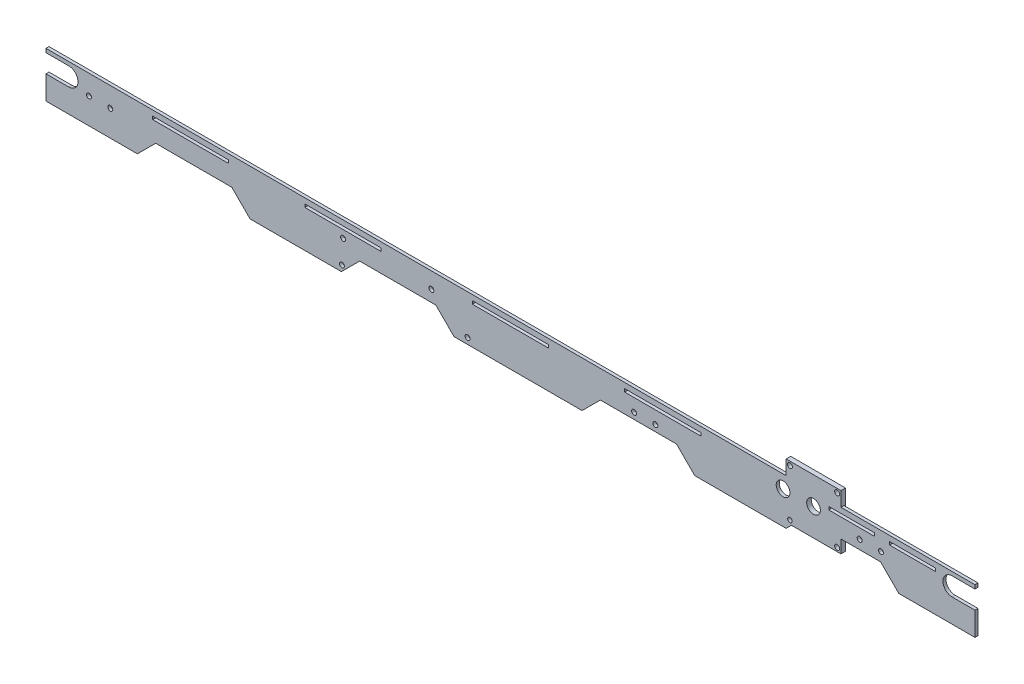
ISO-10303-21;
HEADER;
FILE_DESCRIPTION(('STEP AP214'),'2;1');
FILE_NAME('part.step','',(''),(''),'','','');
FILE_SCHEMA(('AUTOMOTIVE_DESIGN { 1 0 10303 214 1 1 1 1 }'));
ENDSEC;
DATA;
#1=APPLICATION_CONTEXT('core data for automotive mechanical design processes');
#2=APPLICATION_PROTOCOL_DEFINITION('international standard','automotive_design',2000,#1);
#3=PRODUCT_CONTEXT('',#1,'mechanical');
#4=PRODUCT('Part','Part','',(#3));
#5=PRODUCT_RELATED_PRODUCT_CATEGORY('part','',(#4));
#6=PRODUCT_DEFINITION_FORMATION('','',#4);
#7=PRODUCT_DEFINITION_CONTEXT('part definition',#1,'design');
#8=PRODUCT_DEFINITION('design','',#6,#7);
#9=PRODUCT_DEFINITION_SHAPE('','',#8);
#10=(LENGTH_UNIT() NAMED_UNIT(*) SI_UNIT(.MILLI.,.METRE.));
#11=(NAMED_UNIT(*) PLANE_ANGLE_UNIT() SI_UNIT($,.RADIAN.));
#12=(NAMED_UNIT(*) SI_UNIT($,.STERADIAN.) SOLID_ANGLE_UNIT());
#13=UNCERTAINTY_MEASURE_WITH_UNIT(LENGTH_MEASURE(1.E-05),#10,'distance_accuracy_value','');
#14=(GEOMETRIC_REPRESENTATION_CONTEXT(3) GLOBAL_UNCERTAINTY_ASSIGNED_CONTEXT((#13)) GLOBAL_UNIT_ASSIGNED_CONTEXT((#10,
#11,#12)) REPRESENTATION_CONTEXT('',''));
#15=CARTESIAN_POINT('',(0.,0.,0.));
#16=DIRECTION('',(0.,0.,1.));
#17=DIRECTION('',(1.,0.,0.));
#18=AXIS2_PLACEMENT_3D('',#15,#16,#17);
#19=CARTESIAN_POINT('',(176.,-23.4999999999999,-1.));
#20=DIRECTION('',(-1.,0.,0.));
#21=DIRECTION('',(0.,0.,1.));
#22=AXIS2_PLACEMENT_3D('',#19,#20,#21);
#23=PLANE('',#22);
#24=DIRECTION('',(0.,0.,1.));
#25=VECTOR('',#24,1.);
#26=CARTESIAN_POINT('',(176.,-9.53112887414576,-1.));
#27=LINE('',#26,#25);
#28=CARTESIAN_POINT('',(176.,-9.53112887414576,-1.));
#29=VERTEX_POINT('',#28);
#30=CARTESIAN_POINT('',(176.,-9.53112887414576,0.));
#31=VERTEX_POINT('',#30);
#32=EDGE_CURVE('E491',#29,#31,#27,.T.);
#33=ORIENTED_EDGE('',*,*,#32,.F.);
#34=DIRECTION('',(0.,-1.,0.));
#35=VECTOR('',#34,1.);
#36=CARTESIAN_POINT('',(176.,-23.4999999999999,-1.));
#37=LINE('',#36,#35);
#38=CARTESIAN_POINT('',(176.,-23.4999999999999,-1.));
#39=VERTEX_POINT('',#38);
#40=EDGE_CURVE('E626',#29,#39,#37,.T.);
#41=ORIENTED_EDGE('',*,*,#40,.T.);
#42=DIRECTION('',(0.,0.,1.));
#43=VECTOR('',#42,1.);
#44=CARTESIAN_POINT('',(176.,-23.4999999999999,-1.));
#45=LINE('',#44,#43);
#46=CARTESIAN_POINT('',(176.,-23.4999999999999,0.));
#47=VERTEX_POINT('',#46);
#48=EDGE_CURVE('E648',#39,#47,#45,.T.);
#49=ORIENTED_EDGE('',*,*,#48,.T.);
#50=DIRECTION('',(0.,1.,0.));
#51=VECTOR('',#50,1.);
#52=CARTESIAN_POINT('',(176.,0.,0.));
#53=LINE('',#52,#51);
#54=EDGE_CURVE('E924',#47,#31,#53,.T.);
#55=ORIENTED_EDGE('',*,*,#54,.T.);
#56=EDGE_LOOP('',(#33,#41,#49,#55));
#57=FACE_BOUND('',#56,.T.);
#58=ADVANCED_FACE('F39',(#57),#23,.T.);
#59=CARTESIAN_POINT('',(300.,3.00000000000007,2.));
#60=DIRECTION('',(-1.,0.,0.));
#61=DIRECTION('',(0.,0.,1.));
#62=AXIS2_PLACEMENT_3D('',#59,#60,#61);
#63=PLANE('',#62);
#64=DIRECTION('',(0.,1.,0.));
#65=VECTOR('',#64,1.);
#66=CARTESIAN_POINT('',(300.,3.00000000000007,2.));
#67=LINE('',#66,#65);
#68=CARTESIAN_POINT('',(300.,0.500000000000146,2.));
#69=VERTEX_POINT('',#68);
#70=CARTESIAN_POINT('',(300.,3.00000000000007,2.));
#71=VERTEX_POINT('',#70);
#72=EDGE_CURVE('E753',#69,#71,#67,.T.);
#73=ORIENTED_EDGE('',*,*,#72,.F.);
#74=DIRECTION('',(0.,0.,1.));
#75=VECTOR('',#74,1.);
#76=CARTESIAN_POINT('',(300.,0.500000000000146,-1.));
#77=LINE('',#76,#75);
#78=CARTESIAN_POINT('',(300.,0.500000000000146,0.));
#79=VERTEX_POINT('',#78);
#80=EDGE_CURVE('E515',#79,#69,#77,.T.);
#81=ORIENTED_EDGE('',*,*,#80,.F.);
#82=DIRECTION('',(0.,1.,0.));
#83=VECTOR('',#82,1.);
#84=CARTESIAN_POINT('',(300.,3.00000000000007,0.));
#85=LINE('',#84,#83);
#86=CARTESIAN_POINT('',(300.,3.00000000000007,0.));
#87=VERTEX_POINT('',#86);
#88=EDGE_CURVE('E684',#79,#87,#85,.T.);
#89=ORIENTED_EDGE('',*,*,#88,.T.);
#90=DIRECTION('',(0.,0.,-1.));
#91=VECTOR('',#90,1.);
#92=CARTESIAN_POINT('',(300.,3.00000000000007,2.));
#93=LINE('',#92,#91);
#94=EDGE_CURVE('E882',#71,#87,#93,.T.);
#95=ORIENTED_EDGE('',*,*,#94,.F.);
#96=EDGE_LOOP('',(#73,#81,#89,#95));
#97=FACE_BOUND('',#96,.T.);
#98=ADVANCED_FACE('F979',(#97),#63,.F.);
#99=CARTESIAN_POINT('',(-310.,3.,0.));
#100=DIRECTION('',(-1.,0.,0.));
#101=DIRECTION('',(0.,0.,1.));
#102=AXIS2_PLACEMENT_3D('',#99,#100,#101);
#103=PLANE('',#102);
#104=DIRECTION('',(0.,0.,1.));
#105=VECTOR('',#104,1.);
#106=CARTESIAN_POINT('',(-310.,-11.4999999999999,0.));
#107=LINE('',#106,#105);
#108=CARTESIAN_POINT('',(-310.,-11.4999999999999,0.));
#109=VERTEX_POINT('',#108);
#110=CARTESIAN_POINT('',(-310.,-11.4999999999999,2.));
#111=VERTEX_POINT('',#110);
#112=EDGE_CURVE('E943',#109,#111,#107,.T.);
#113=ORIENTED_EDGE('',*,*,#112,.F.);
#114=DIRECTION('',(0.,-1.,0.));
#115=VECTOR('',#114,1.);
#116=CARTESIAN_POINT('',(-310.,3.,0.));
#117=LINE('',#116,#115);
#118=CARTESIAN_POINT('',(-310.,-27.,0.));
#119=VERTEX_POINT('',#118);
#120=EDGE_CURVE('E581',#109,#119,#117,.T.);
#121=ORIENTED_EDGE('',*,*,#120,.T.);
#122=DIRECTION('',(0.,0.,1.));
#123=VECTOR('',#122,1.);
#124=CARTESIAN_POINT('',(-310.,-27.,0.));
#125=LINE('',#124,#123);
#126=CARTESIAN_POINT('',(-310.,-27.,2.));
#127=VERTEX_POINT('',#126);
#128=EDGE_CURVE('E585',#119,#127,#125,.T.);
#129=ORIENTED_EDGE('',*,*,#128,.T.);
#130=DIRECTION('',(0.,-1.,0.));
#131=VECTOR('',#130,1.);
#132=CARTESIAN_POINT('',(-310.,3.,2.));
#133=LINE('',#132,#131);
#134=EDGE_CURVE('E576',#111,#127,#133,.T.);
#135=ORIENTED_EDGE('',*,*,#134,.F.);
#136=EDGE_LOOP('',(#113,#121,#129,#135));
#137=FACE_BOUND('',#136,.T.);
#138=ADVANCED_FACE('F988',(#137),#103,.T.);
#139=CARTESIAN_POINT('',(-300.,3.,2.));
#140=DIRECTION('',(0.,-1.,0.));
#141=DIRECTION('',(1.,0.,0.));
#142=AXIS2_PLACEMENT_3D('',#139,#140,#141);
#143=PLANE('',#142);
#144=DIRECTION('',(-1.,0.,0.));
#145=VECTOR('',#144,1.);
#146=CARTESIAN_POINT('',(-300.,3.,0.));
#147=LINE('',#146,#145);
#148=CARTESIAN_POINT('',(212.,3.00000000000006,0.));
#149=VERTEX_POINT('',#148);
#150=EDGE_CURVE('E797',#87,#149,#147,.T.);
#151=ORIENTED_EDGE('',*,*,#150,.T.);
#152=DIRECTION('',(0.,0.,1.));
#153=VECTOR('',#152,1.);
#154=CARTESIAN_POINT('',(212.,3.00000000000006,2.));
#155=LINE('',#154,#153);
#156=CARTESIAN_POINT('',(212.,3.00000000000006,2.));
#157=VERTEX_POINT('',#156);
#158=EDGE_CURVE('E663',#149,#157,#155,.T.);
#159=ORIENTED_EDGE('',*,*,#158,.T.);
#160=DIRECTION('',(-1.,0.,0.));
#161=VECTOR('',#160,1.);
#162=CARTESIAN_POINT('',(-300.,3.,2.));
#163=LINE('',#162,#161);
#164=EDGE_CURVE('E754',#71,#157,#163,.T.);
#165=ORIENTED_EDGE('',*,*,#164,.F.);
#166=ORIENTED_EDGE('',*,*,#94,.T.);
#167=EDGE_LOOP('',(#151,#159,#165,#166));
#168=FACE_BOUND('',#167,.T.);
#169=ADVANCED_FACE('F1224',(#168),#143,.F.);
#170=CARTESIAN_POINT('',(0.,0.,0.));
#171=DIRECTION('',(0.,0.,-1.));
#172=DIRECTION('',(-1.,0.,0.));
#173=AXIS2_PLACEMENT_3D('',#170,#171,#172);
#174=PLANE('',#173);
#175=DIRECTION('',(0.,-1.,0.));
#176=VECTOR('',#175,1.);
#177=CARTESIAN_POINT('',(273.999999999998,-0.500000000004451,0.));
#178=LINE('',#177,#176);
#179=CARTESIAN_POINT('',(273.999999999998,-0.500000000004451,0.));
#180=VERTEX_POINT('',#179);
#181=CARTESIAN_POINT('',(273.999999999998,-2.50000000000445,0.));
#182=VERTEX_POINT('',#181);
#183=EDGE_CURVE('E54',#180,#182,#178,.T.);
#184=ORIENTED_EDGE('',*,*,#183,.F.);
#185=DIRECTION('',(1.,0.,0.));
#186=VECTOR('',#185,1.);
#187=CARTESIAN_POINT('',(273.999999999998,-0.500000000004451,0.));
#188=LINE('',#187,#186);
#189=CARTESIAN_POINT('',(243.999999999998,-0.500000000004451,0.));
#190=VERTEX_POINT('',#189);
#191=EDGE_CURVE('E447',#190,#180,#188,.T.);
#192=ORIENTED_EDGE('',*,*,#191,.F.);
#193=DIRECTION('',(0.,1.,0.));
#194=VECTOR('',#193,1.);
#195=CARTESIAN_POINT('',(243.999999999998,-0.500000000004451,0.));
#196=LINE('',#195,#194);
#197=CARTESIAN_POINT('',(243.999999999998,-2.50000000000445,0.));
#198=VERTEX_POINT('',#197);
#199=EDGE_CURVE('E431',#198,#190,#196,.T.);
#200=ORIENTED_EDGE('',*,*,#199,.F.);
#201=DIRECTION('',(-1.,0.,0.));
#202=VECTOR('',#201,1.);
#203=CARTESIAN_POINT('',(273.999999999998,-2.50000000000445,0.));
#204=LINE('',#203,#202);
#205=EDGE_CURVE('E440',#182,#198,#204,.T.);
#206=ORIENTED_EDGE('',*,*,#205,.F.);
#207=EDGE_LOOP('',(#184,#192,#200,#206));
#208=FACE_BOUND('',#207,.T.);
#209=DIRECTION('',(1.,0.,0.));
#210=VECTOR('',#209,1.);
#211=CARTESIAN_POINT('',(233.999999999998,-0.500000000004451,0.));
#212=LINE('',#211,#210);
#213=CARTESIAN_POINT('',(212.,-0.500000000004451,0.));
#214=VERTEX_POINT('',#213);
#215=CARTESIAN_POINT('',(233.999999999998,-0.500000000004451,0.));
#216=VERTEX_POINT('',#215);
#217=EDGE_CURVE('E459',#214,#216,#212,.T.);
#218=ORIENTED_EDGE('',*,*,#217,.F.);
#219=DIRECTION('',(0.,-1.,0.));
#220=VECTOR('',#219,1.);
#221=CARTESIAN_POINT('',(212.,0.,0.));
#222=LINE('',#221,#220);
#223=EDGE_CURVE('E931',#149,#214,#222,.T.);
#224=ORIENTED_EDGE('',*,*,#223,.F.);
#225=ORIENTED_EDGE('',*,*,#150,.F.);
#226=ORIENTED_EDGE('',*,*,#88,.F.);
#227=DIRECTION('',(1.,0.,0.));
#228=VECTOR('',#227,1.);
#229=CARTESIAN_POINT('',(0.,0.500000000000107,0.));
#230=LINE('',#229,#228);
#231=CARTESIAN_POINT('',(285.,0.500000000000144,0.));
#232=VERTEX_POINT('',#231);
#233=EDGE_CURVE('E528',#232,#79,#230,.T.);
#234=ORIENTED_EDGE('',*,*,#233,.F.);
#235=CARTESIAN_POINT('',(285.,-5.49999999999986,0.));
#236=DIRECTION('',(0.,0.,-1.));
#237=DIRECTION('',(-1.,0.,0.));
#238=AXIS2_PLACEMENT_3D('',#235,#236,#237);
#239=CIRCLE('',#238,6.);
#240=CARTESIAN_POINT('',(285.,-11.4999999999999,0.));
#241=VERTEX_POINT('',#240);
#242=EDGE_CURVE('E530',#241,#232,#239,.T.);
#243=ORIENTED_EDGE('',*,*,#242,.F.);
#244=DIRECTION('',(-1.,0.,0.));
#245=VECTOR('',#244,1.);
#246=CARTESIAN_POINT('',(0.,-11.4999999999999,0.));
#247=LINE('',#246,#245);
#248=CARTESIAN_POINT('',(300.,-11.4999999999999,0.));
#249=VERTEX_POINT('',#248);
#250=EDGE_CURVE('E526',#249,#241,#247,.T.);
#251=ORIENTED_EDGE('',*,*,#250,.F.);
#252=CARTESIAN_POINT('',(300.,-27.,0.));
#253=VERTEX_POINT('',#252);
#254=EDGE_CURVE('E793',#253,#249,#85,.T.);
#255=ORIENTED_EDGE('',*,*,#254,.F.);
#256=DIRECTION('',(1.,0.,0.));
#257=VECTOR('',#256,1.);
#258=CARTESIAN_POINT('',(300.,-27.,0.));
#259=LINE('',#258,#257);
#260=CARTESIAN_POINT('',(250.,-27.,0.));
#261=VERTEX_POINT('',#260);
#262=EDGE_CURVE('E833',#261,#253,#259,.T.);
#263=ORIENTED_EDGE('',*,*,#262,.F.);
#264=DIRECTION('',(0.707106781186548,-0.707106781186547,0.));
#265=VECTOR('',#264,1.);
#266=CARTESIAN_POINT('',(250.,-27.,0.));
#267=LINE('',#266,#265);
#268=CARTESIAN_POINT('',(238.,-15.,0.));
#269=VERTEX_POINT('',#268);
#270=EDGE_CURVE('E831',#269,#261,#267,.T.);
#271=ORIENTED_EDGE('',*,*,#270,.F.);
#272=DIRECTION('',(1.,0.,0.));
#273=VECTOR('',#272,1.);
#274=CARTESIAN_POINT('',(238.,-15.,0.));
#275=LINE('',#274,#273);
#276=CARTESIAN_POINT('',(212.,-15.,0.));
#277=VERTEX_POINT('',#276);
#278=EDGE_CURVE('E829',#277,#269,#275,.T.);
#279=ORIENTED_EDGE('',*,*,#278,.F.);
#280=CARTESIAN_POINT('',(212.,-2.50000000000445,0.));
#281=VERTEX_POINT('',#280);
#282=EDGE_CURVE('E930',#281,#277,#222,.T.);
#283=ORIENTED_EDGE('',*,*,#282,.F.);
#284=DIRECTION('',(-1.,0.,0.));
#285=VECTOR('',#284,1.);
#286=CARTESIAN_POINT('',(233.999999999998,-2.50000000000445,0.));
#287=LINE('',#286,#285);
#288=CARTESIAN_POINT('',(233.999999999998,-2.50000000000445,0.));
#289=VERTEX_POINT('',#288);
#290=EDGE_CURVE('E474',#289,#281,#287,.T.);
#291=ORIENTED_EDGE('',*,*,#290,.F.);
#292=DIRECTION('',(0.,-1.,0.));
#293=VECTOR('',#292,1.);
#294=CARTESIAN_POINT('',(233.999999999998,-0.500000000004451,0.));
#295=LINE('',#294,#293);
#296=EDGE_CURVE('E476',#216,#289,#295,.T.);
#297=ORIENTED_EDGE('',*,*,#296,.F.);
#298=EDGE_LOOP('',(#218,#224,#225,#226,#234,#243,#251,#255,#263,#271,#279,#283,#291,#297));
#299=FACE_BOUND('',#298,.T.);
#300=CARTESIAN_POINT('',(224.273370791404,-8.99999999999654,0.));
#301=DIRECTION('',(0.,0.,-1.));
#302=DIRECTION('',(-1.,0.,0.));
#303=AXIS2_PLACEMENT_3D('',#300,#301,#302);
#304=CIRCLE('',#303,1.62499999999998);
#305=CARTESIAN_POINT('',(222.648370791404,-8.99999999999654,0.));
#306=VERTEX_POINT('',#305);
#307=EDGE_CURVE('E549',#306,#306,#304,.T.);
#308=ORIENTED_EDGE('',*,*,#307,.F.);
#309=EDGE_LOOP('',(#308));
#310=FACE_BOUND('',#309,.T.);
#311=CARTESIAN_POINT('',(238.273370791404,-8.99999999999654,0.));
#312=DIRECTION('',(0.,0.,-1.));
#313=DIRECTION('',(-1.,0.,0.));
#314=AXIS2_PLACEMENT_3D('',#311,#312,#313);
#315=CIRCLE('',#314,1.62499999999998);
#316=CARTESIAN_POINT('',(236.648370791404,-8.99999999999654,0.));
#317=VERTEX_POINT('',#316);
#318=EDGE_CURVE('E542',#317,#317,#315,.T.);
#319=ORIENTED_EDGE('',*,*,#318,.F.);
#320=EDGE_LOOP('',(#319));
#321=FACE_BOUND('',#320,.T.);
#322=ADVANCED_FACE('F444',(#208,#299,#310,#321),#174,.T.);
#323=ORIENTED_EDGE('',*,*,#254,.T.);
#324=DIRECTION('',(0.,0.,1.));
#325=VECTOR('',#324,1.);
#326=CARTESIAN_POINT('',(300.,-11.4999999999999,-1.));
#327=LINE('',#326,#325);
#328=CARTESIAN_POINT('',(300.,-11.4999999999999,2.));
#329=VERTEX_POINT('',#328);
#330=EDGE_CURVE('E512',#249,#329,#327,.T.);
#331=ORIENTED_EDGE('',*,*,#330,.T.);
#332=CARTESIAN_POINT('',(300.,-27.,2.));
#333=VERTEX_POINT('',#332);
#334=EDGE_CURVE('E749',#333,#329,#67,.T.);
#335=ORIENTED_EDGE('',*,*,#334,.F.);
#336=DIRECTION('',(0.,0.,-1.));
#337=VECTOR('',#336,1.);
#338=CARTESIAN_POINT('',(300.,-27.,2.));
#339=LINE('',#338,#337);
#340=EDGE_CURVE('E792',#333,#253,#339,.T.);
#341=ORIENTED_EDGE('',*,*,#340,.T.);
#342=EDGE_LOOP('',(#323,#331,#335,#341));
#343=FACE_BOUND('',#342,.T.);
#344=ADVANCED_FACE('F41',(#343),#63,.F.);
#345=CARTESIAN_POINT('',(176.,3.00000000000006,2.));
#346=VERTEX_POINT('',#345);
#347=CARTESIAN_POINT('',(-310.,3.,2.));
#348=VERTEX_POINT('',#347);
#349=EDGE_CURVE('E752',#346,#348,#163,.T.);
#350=ORIENTED_EDGE('',*,*,#349,.F.);
#351=DIRECTION('',(0.,0.,-1.));
#352=VECTOR('',#351,1.);
#353=CARTESIAN_POINT('',(176.,3.00000000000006,2.));
#354=LINE('',#353,#352);
#355=CARTESIAN_POINT('',(176.,3.00000000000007,0.));
#356=VERTEX_POINT('',#355);
#357=EDGE_CURVE('E655',#346,#356,#354,.T.);
#358=ORIENTED_EDGE('',*,*,#357,.T.);
#359=CARTESIAN_POINT('',(-310.,3.,0.));
#360=VERTEX_POINT('',#359);
#361=EDGE_CURVE('E796',#356,#360,#147,.T.);
#362=ORIENTED_EDGE('',*,*,#361,.T.);
#363=DIRECTION('',(0.,0.,1.));
#364=VECTOR('',#363,1.);
#365=CARTESIAN_POINT('',(-310.,3.,0.));
#366=LINE('',#365,#364);
#367=EDGE_CURVE('E580',#360,#348,#366,.T.);
#368=ORIENTED_EDGE('',*,*,#367,.T.);
#369=EDGE_LOOP('',(#350,#358,#362,#368));
#370=FACE_BOUND('',#369,.T.);
#371=ADVANCED_FACE('F1020',(#370),#143,.F.);
#372=CARTESIAN_POINT('',(-300.,-27.0000000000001,2.));
#373=DIRECTION('',(0.,1.,0.));
#374=DIRECTION('',(0.,0.,1.));
#375=AXIS2_PLACEMENT_3D('',#372,#373,#374);
#376=PLANE('',#375);
#377=DIRECTION('',(1.,0.,0.));
#378=VECTOR('',#377,1.);
#379=CARTESIAN_POINT('',(-300.,-27.0000000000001,0.));
#380=LINE('',#379,#378);
#381=CARTESIAN_POINT('',(-250.,-27.0000000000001,0.));
#382=VERTEX_POINT('',#381);
#383=EDGE_CURVE('E800',#119,#382,#380,.T.);
#384=ORIENTED_EDGE('',*,*,#383,.T.);
#385=DIRECTION('',(0.,0.,-1.));
#386=VECTOR('',#385,1.);
#387=CARTESIAN_POINT('',(-250.,-27.0000000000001,2.));
#388=LINE('',#387,#386);
#389=CARTESIAN_POINT('',(-250.,-27.0000000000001,2.));
#390=VERTEX_POINT('',#389);
#391=EDGE_CURVE('E879',#390,#382,#388,.T.);
#392=ORIENTED_EDGE('',*,*,#391,.F.);
#393=DIRECTION('',(1.,0.,0.));
#394=VECTOR('',#393,1.);
#395=CARTESIAN_POINT('',(-300.,-27.0000000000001,2.));
#396=LINE('',#395,#394);
#397=EDGE_CURVE('E757',#127,#390,#396,.T.);
#398=ORIENTED_EDGE('',*,*,#397,.F.);
#399=ORIENTED_EDGE('',*,*,#128,.F.);
#400=EDGE_LOOP('',(#384,#392,#398,#399));
#401=FACE_BOUND('',#400,.T.);
#402=ADVANCED_FACE('F1106',(#401),#376,.F.);
#403=CARTESIAN_POINT('',(-250.,-27.0000000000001,2.));
#404=DIRECTION('',(-0.707106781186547,0.707106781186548,0.));
#405=DIRECTION('',(-0.707106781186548,-0.707106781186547,0.));
#406=AXIS2_PLACEMENT_3D('',#403,#404,#405);
#407=PLANE('',#406);
#408=DIRECTION('',(0.707106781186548,0.707106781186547,0.));
#409=VECTOR('',#408,1.);
#410=CARTESIAN_POINT('',(-250.,-27.0000000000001,0.));
#411=LINE('',#410,#409);
#412=CARTESIAN_POINT('',(-238.,-15.0000000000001,0.));
#413=VERTEX_POINT('',#412);
#414=EDGE_CURVE('E802',#382,#413,#411,.T.);
#415=ORIENTED_EDGE('',*,*,#414,.T.);
#416=DIRECTION('',(0.,0.,-1.));
#417=VECTOR('',#416,1.);
#418=CARTESIAN_POINT('',(-238.,-15.0000000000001,2.));
#419=LINE('',#418,#417);
#420=CARTESIAN_POINT('',(-238.,-15.0000000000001,2.));
#421=VERTEX_POINT('',#420);
#422=EDGE_CURVE('E876',#421,#413,#419,.T.);
#423=ORIENTED_EDGE('',*,*,#422,.F.);
#424=DIRECTION('',(0.707106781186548,0.707106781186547,0.));
#425=VECTOR('',#424,1.);
#426=CARTESIAN_POINT('',(-250.,-27.0000000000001,2.));
#427=LINE('',#426,#425);
#428=EDGE_CURVE('E759',#390,#421,#427,.T.);
#429=ORIENTED_EDGE('',*,*,#428,.F.);
#430=ORIENTED_EDGE('',*,*,#391,.T.);
#431=EDGE_LOOP('',(#415,#423,#429,#430));
#432=FACE_BOUND('',#431,.T.);
#433=ADVANCED_FACE('F1102',(#432),#407,.F.);
#434=CARTESIAN_POINT('',(-238.,-15.0000000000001,2.));
#435=DIRECTION('',(0.,1.,0.));
#436=DIRECTION('',(-1.,0.,0.));
#437=AXIS2_PLACEMENT_3D('',#434,#435,#436);
#438=PLANE('',#437);
#439=DIRECTION('',(1.,0.,0.));
#440=VECTOR('',#439,1.);
#441=CARTESIAN_POINT('',(-238.,-15.0000000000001,0.));
#442=LINE('',#441,#440);
#443=CARTESIAN_POINT('',(-188.,-15.0000000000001,0.));
#444=VERTEX_POINT('',#443);
#445=EDGE_CURVE('E804',#413,#444,#442,.T.);
#446=ORIENTED_EDGE('',*,*,#445,.T.);
#447=DIRECTION('',(0.,0.,-1.));
#448=VECTOR('',#447,1.);
#449=CARTESIAN_POINT('',(-188.,-15.0000000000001,2.));
#450=LINE('',#449,#448);
#451=CARTESIAN_POINT('',(-188.,-15.0000000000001,2.));
#452=VERTEX_POINT('',#451);
#453=EDGE_CURVE('E873',#452,#444,#450,.T.);
#454=ORIENTED_EDGE('',*,*,#453,.F.);
#455=DIRECTION('',(1.,0.,0.));
#456=VECTOR('',#455,1.);
#457=CARTESIAN_POINT('',(-238.,-15.0000000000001,2.));
#458=LINE('',#457,#456);
#459=EDGE_CURVE('E761',#421,#452,#458,.T.);
#460=ORIENTED_EDGE('',*,*,#459,.F.);
#461=ORIENTED_EDGE('',*,*,#422,.T.);
#462=EDGE_LOOP('',(#446,#454,#460,#461));
#463=FACE_BOUND('',#462,.T.);
#464=ADVANCED_FACE('F1097',(#463),#438,.F.);
#465=CARTESIAN_POINT('',(-188.,-15.0000000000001,2.));
#466=DIRECTION('',(0.707106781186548,0.707106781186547,0.));
#467=DIRECTION('',(-0.707106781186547,0.707106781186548,0.));
#468=AXIS2_PLACEMENT_3D('',#465,#466,#467);
#469=PLANE('',#468);
#470=DIRECTION('',(0.707106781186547,-0.707106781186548,0.));
#471=VECTOR('',#470,1.);
#472=CARTESIAN_POINT('',(-188.,-15.0000000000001,0.));
#473=LINE('',#472,#471);
#474=CARTESIAN_POINT('',(-176.,-27.,0.));
#475=VERTEX_POINT('',#474);
#476=EDGE_CURVE('E806',#444,#475,#473,.T.);
#477=ORIENTED_EDGE('',*,*,#476,.T.);
#478=DIRECTION('',(0.,0.,-1.));
#479=VECTOR('',#478,1.);
#480=CARTESIAN_POINT('',(-176.,-27.,2.));
#481=LINE('',#480,#479);
#482=CARTESIAN_POINT('',(-176.,-27.,2.));
#483=VERTEX_POINT('',#482);
#484=EDGE_CURVE('E870',#483,#475,#481,.T.);
#485=ORIENTED_EDGE('',*,*,#484,.F.);
#486=DIRECTION('',(0.707106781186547,-0.707106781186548,0.));
#487=VECTOR('',#486,1.);
#488=CARTESIAN_POINT('',(-188.,-15.0000000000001,2.));
#489=LINE('',#488,#487);
#490=EDGE_CURVE('E763',#452,#483,#489,.T.);
#491=ORIENTED_EDGE('',*,*,#490,.F.);
#492=ORIENTED_EDGE('',*,*,#453,.T.);
#493=EDGE_LOOP('',(#477,#485,#491,#492));
#494=FACE_BOUND('',#493,.T.);
#495=ADVANCED_FACE('F1091',(#494),#469,.F.);
#496=CARTESIAN_POINT('',(-116.02,-27.,2.));
#497=DIRECTION('',(0.,1.,0.));
#498=DIRECTION('',(-1.,0.,0.));
#499=AXIS2_PLACEMENT_3D('',#496,#497,#498);
#500=PLANE('',#499);
#501=DIRECTION('',(1.,0.,0.));
#502=VECTOR('',#501,1.);
#503=CARTESIAN_POINT('',(-116.02,-27.,0.));
#504=LINE('',#503,#502);
#505=CARTESIAN_POINT('',(-116.02,-27.,0.));
#506=VERTEX_POINT('',#505);
#507=EDGE_CURVE('E808',#475,#506,#504,.T.);
#508=ORIENTED_EDGE('',*,*,#507,.T.);
#509=DIRECTION('',(0.,0.,-1.));
#510=VECTOR('',#509,1.);
#511=CARTESIAN_POINT('',(-116.02,-27.,2.));
#512=LINE('',#511,#510);
#513=CARTESIAN_POINT('',(-116.02,-27.,2.));
#514=VERTEX_POINT('',#513);
#515=EDGE_CURVE('E867',#514,#506,#512,.T.);
#516=ORIENTED_EDGE('',*,*,#515,.F.);
#517=DIRECTION('',(1.,0.,0.));
#518=VECTOR('',#517,1.);
#519=CARTESIAN_POINT('',(-116.02,-27.,2.));
#520=LINE('',#519,#518);
#521=EDGE_CURVE('E765',#483,#514,#520,.T.);
#522=ORIENTED_EDGE('',*,*,#521,.F.);
#523=ORIENTED_EDGE('',*,*,#484,.T.);
#524=EDGE_LOOP('',(#508,#516,#522,#523));
#525=FACE_BOUND('',#524,.T.);
#526=ADVANCED_FACE('F1087',(#525),#500,.F.);
#527=CARTESIAN_POINT('',(-116.02,-27.,2.));
#528=DIRECTION('',(-0.707106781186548,0.707106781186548,0.));
#529=DIRECTION('',(-0.707106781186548,-0.707106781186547,0.));
#530=AXIS2_PLACEMENT_3D('',#527,#528,#529);
#531=PLANE('',#530);
#532=DIRECTION('',(0.707106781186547,0.707106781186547,0.));
#533=VECTOR('',#532,1.);
#534=CARTESIAN_POINT('',(-116.02,-27.,0.));
#535=LINE('',#534,#533);
#536=CARTESIAN_POINT('',(-104.02,-15.,0.));
#537=VERTEX_POINT('',#536);
#538=EDGE_CURVE('E810',#506,#537,#535,.T.);
#539=ORIENTED_EDGE('',*,*,#538,.T.);
#540=DIRECTION('',(0.,0.,-1.));
#541=VECTOR('',#540,1.);
#542=CARTESIAN_POINT('',(-104.02,-15.,2.));
#543=LINE('',#542,#541);
#544=CARTESIAN_POINT('',(-104.02,-15.,2.));
#545=VERTEX_POINT('',#544);
#546=EDGE_CURVE('E864',#545,#537,#543,.T.);
#547=ORIENTED_EDGE('',*,*,#546,.F.);
#548=DIRECTION('',(0.707106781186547,0.707106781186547,0.));
#549=VECTOR('',#548,1.);
#550=CARTESIAN_POINT('',(-116.02,-27.,2.));
#551=LINE('',#550,#549);
#552=EDGE_CURVE('E767',#514,#545,#551,.T.);
#553=ORIENTED_EDGE('',*,*,#552,.F.);
#554=ORIENTED_EDGE('',*,*,#515,.T.);
#555=EDGE_LOOP('',(#539,#547,#553,#554));
#556=FACE_BOUND('',#555,.T.);
#557=ADVANCED_FACE('F1082',(#556),#531,.F.);
#558=CARTESIAN_POINT('',(-104.02,-15.,2.));
#559=DIRECTION('',(0.,1.,0.));
#560=DIRECTION('',(-1.,0.,0.));
#561=AXIS2_PLACEMENT_3D('',#558,#559,#560);
#562=PLANE('',#561);
#563=DIRECTION('',(1.,0.,0.));
#564=VECTOR('',#563,1.);
#565=CARTESIAN_POINT('',(-104.02,-15.,0.));
#566=LINE('',#565,#564);
#567=CARTESIAN_POINT('',(-54.02,-15.,0.));
#568=VERTEX_POINT('',#567);
#569=EDGE_CURVE('E812',#537,#568,#566,.T.);
#570=ORIENTED_EDGE('',*,*,#569,.T.);
#571=DIRECTION('',(0.,0.,-1.));
#572=VECTOR('',#571,1.);
#573=CARTESIAN_POINT('',(-54.02,-15.,2.));
#574=LINE('',#573,#572);
#575=CARTESIAN_POINT('',(-54.02,-15.,2.));
#576=VERTEX_POINT('',#575);
#577=EDGE_CURVE('E861',#576,#568,#574,.T.);
#578=ORIENTED_EDGE('',*,*,#577,.F.);
#579=DIRECTION('',(1.,0.,0.));
#580=VECTOR('',#579,1.);
#581=CARTESIAN_POINT('',(-104.02,-15.,2.));
#582=LINE('',#581,#580);
#583=EDGE_CURVE('E769',#545,#576,#582,.T.);
#584=ORIENTED_EDGE('',*,*,#583,.F.);
#585=ORIENTED_EDGE('',*,*,#546,.T.);
#586=EDGE_LOOP('',(#570,#578,#584,#585));
#587=FACE_BOUND('',#586,.T.);
#588=ADVANCED_FACE('F1076',(#587),#562,.F.);
#589=CARTESIAN_POINT('',(-54.02,-15.,2.));
#590=DIRECTION('',(0.707106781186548,0.707106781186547,0.));
#591=DIRECTION('',(-0.707106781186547,0.707106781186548,0.));
#592=AXIS2_PLACEMENT_3D('',#589,#590,#591);
#593=PLANE('',#592);
#594=DIRECTION('',(0.707106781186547,-0.707106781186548,0.));
#595=VECTOR('',#594,1.);
#596=CARTESIAN_POINT('',(-54.02,-15.,0.));
#597=LINE('',#596,#595);
#598=CARTESIAN_POINT('',(-42.02,-27.,0.));
#599=VERTEX_POINT('',#598);
#600=EDGE_CURVE('E814',#568,#599,#597,.T.);
#601=ORIENTED_EDGE('',*,*,#600,.T.);
#602=DIRECTION('',(0.,0.,-1.));
#603=VECTOR('',#602,1.);
#604=CARTESIAN_POINT('',(-42.02,-27.,2.));
#605=LINE('',#604,#603);
#606=CARTESIAN_POINT('',(-42.02,-27.,2.));
#607=VERTEX_POINT('',#606);
#608=EDGE_CURVE('E858',#607,#599,#605,.T.);
#609=ORIENTED_EDGE('',*,*,#608,.F.);
#610=DIRECTION('',(0.707106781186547,-0.707106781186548,0.));
#611=VECTOR('',#610,1.);
#612=CARTESIAN_POINT('',(-54.02,-15.,2.));
#613=LINE('',#612,#611);
#614=EDGE_CURVE('E771',#576,#607,#613,.T.);
#615=ORIENTED_EDGE('',*,*,#614,.F.);
#616=ORIENTED_EDGE('',*,*,#577,.T.);
#617=EDGE_LOOP('',(#601,#609,#615,#616));
#618=FACE_BOUND('',#617,.T.);
#619=ADVANCED_FACE('F1072',(#618),#593,.F.);
#620=CARTESIAN_POINT('',(42.02,-27.,2.));
#621=DIRECTION('',(0.,1.,0.));
#622=DIRECTION('',(-1.,0.,0.));
#623=AXIS2_PLACEMENT_3D('',#620,#621,#622);
#624=PLANE('',#623);
#625=DIRECTION('',(1.,0.,0.));
#626=VECTOR('',#625,1.);
#627=CARTESIAN_POINT('',(42.02,-27.,0.));
#628=LINE('',#627,#626);
#629=CARTESIAN_POINT('',(42.02,-27.,0.));
#630=VERTEX_POINT('',#629);
#631=EDGE_CURVE('E816',#599,#630,#628,.T.);
#632=ORIENTED_EDGE('',*,*,#631,.T.);
#633=DIRECTION('',(0.,0.,-1.));
#634=VECTOR('',#633,1.);
#635=CARTESIAN_POINT('',(42.02,-27.,2.));
#636=LINE('',#635,#634);
#637=CARTESIAN_POINT('',(42.02,-27.,2.));
#638=VERTEX_POINT('',#637);
#639=EDGE_CURVE('E855',#638,#630,#636,.T.);
#640=ORIENTED_EDGE('',*,*,#639,.F.);
#641=DIRECTION('',(1.,0.,0.));
#642=VECTOR('',#641,1.);
#643=CARTESIAN_POINT('',(42.02,-27.,2.));
#644=LINE('',#643,#642);
#645=EDGE_CURVE('E773',#607,#638,#644,.T.);
#646=ORIENTED_EDGE('',*,*,#645,.F.);
#647=ORIENTED_EDGE('',*,*,#608,.T.);
#648=EDGE_LOOP('',(#632,#640,#646,#647));
#649=FACE_BOUND('',#648,.T.);
#650=ADVANCED_FACE('F1067',(#649),#624,.F.);
#651=CARTESIAN_POINT('',(54.02,-15.,2.));
#652=DIRECTION('',(-0.707106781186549,0.707106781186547,0.));
#653=DIRECTION('',(-0.707106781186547,-0.707106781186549,0.));
#654=AXIS2_PLACEMENT_3D('',#651,#652,#653);
#655=PLANE('',#654);
#656=DIRECTION('',(0.707106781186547,0.707106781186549,0.));
#657=VECTOR('',#656,1.);
#658=CARTESIAN_POINT('',(54.02,-15.,0.));
#659=LINE('',#658,#657);
#660=CARTESIAN_POINT('',(54.02,-15.,0.));
#661=VERTEX_POINT('',#660);
#662=EDGE_CURVE('E818',#630,#661,#659,.T.);
#663=ORIENTED_EDGE('',*,*,#662,.T.);
#664=DIRECTION('',(0.,0.,-1.));
#665=VECTOR('',#664,1.);
#666=CARTESIAN_POINT('',(54.02,-15.,2.));
#667=LINE('',#666,#665);
#668=CARTESIAN_POINT('',(54.02,-15.,2.));
#669=VERTEX_POINT('',#668);
#670=EDGE_CURVE('E852',#669,#661,#667,.T.);
#671=ORIENTED_EDGE('',*,*,#670,.F.);
#672=DIRECTION('',(0.707106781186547,0.707106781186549,0.));
#673=VECTOR('',#672,1.);
#674=CARTESIAN_POINT('',(54.02,-15.,2.));
#675=LINE('',#674,#673);
#676=EDGE_CURVE('E775',#638,#669,#675,.T.);
#677=ORIENTED_EDGE('',*,*,#676,.F.);
#678=ORIENTED_EDGE('',*,*,#639,.T.);
#679=EDGE_LOOP('',(#663,#671,#677,#678));
#680=FACE_BOUND('',#679,.T.);
#681=ADVANCED_FACE('F1061',(#680),#655,.F.);
#682=CARTESIAN_POINT('',(104.02,-15.,2.));
#683=DIRECTION('',(0.,1.,0.));
#684=DIRECTION('',(-1.,0.,0.));
#685=AXIS2_PLACEMENT_3D('',#682,#683,#684);
#686=PLANE('',#685);
#687=DIRECTION('',(1.,0.,0.));
#688=VECTOR('',#687,1.);
#689=CARTESIAN_POINT('',(104.02,-15.,0.));
#690=LINE('',#689,#688);
#691=CARTESIAN_POINT('',(104.02,-15.,0.));
#692=VERTEX_POINT('',#691);
#693=EDGE_CURVE('E820',#661,#692,#690,.T.);
#694=ORIENTED_EDGE('',*,*,#693,.T.);
#695=DIRECTION('',(0.,0.,-1.));
#696=VECTOR('',#695,1.);
#697=CARTESIAN_POINT('',(104.02,-15.,2.));
#698=LINE('',#697,#696);
#699=CARTESIAN_POINT('',(104.02,-15.,2.));
#700=VERTEX_POINT('',#699);
#701=EDGE_CURVE('E849',#700,#692,#698,.T.);
#702=ORIENTED_EDGE('',*,*,#701,.F.);
#703=DIRECTION('',(1.,0.,0.));
#704=VECTOR('',#703,1.);
#705=CARTESIAN_POINT('',(104.02,-15.,2.));
#706=LINE('',#705,#704);
#707=EDGE_CURVE('E777',#669,#700,#706,.T.);
#708=ORIENTED_EDGE('',*,*,#707,.F.);
#709=ORIENTED_EDGE('',*,*,#670,.T.);
#710=EDGE_LOOP('',(#694,#702,#708,#709));
#711=FACE_BOUND('',#710,.T.);
#712=ADVANCED_FACE('F1057',(#711),#686,.F.);
#713=CARTESIAN_POINT('',(116.02,-27.,2.));
#714=DIRECTION('',(0.707106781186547,0.707106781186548,0.));
#715=DIRECTION('',(-0.707106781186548,0.707106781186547,0.));
#716=AXIS2_PLACEMENT_3D('',#713,#714,#715);
#717=PLANE('',#716);
#718=DIRECTION('',(0.707106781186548,-0.707106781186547,0.));
#719=VECTOR('',#718,1.);
#720=CARTESIAN_POINT('',(116.02,-27.,0.));
#721=LINE('',#720,#719);
#722=CARTESIAN_POINT('',(116.02,-27.,0.));
#723=VERTEX_POINT('',#722);
#724=EDGE_CURVE('E822',#692,#723,#721,.T.);
#725=ORIENTED_EDGE('',*,*,#724,.T.);
#726=DIRECTION('',(0.,0.,-1.));
#727=VECTOR('',#726,1.);
#728=CARTESIAN_POINT('',(116.02,-27.,2.));
#729=LINE('',#728,#727);
#730=CARTESIAN_POINT('',(116.02,-27.,2.));
#731=VERTEX_POINT('',#730);
#732=EDGE_CURVE('E846',#731,#723,#729,.T.);
#733=ORIENTED_EDGE('',*,*,#732,.F.);
#734=DIRECTION('',(0.707106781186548,-0.707106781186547,0.));
#735=VECTOR('',#734,1.);
#736=CARTESIAN_POINT('',(116.02,-27.,2.));
#737=LINE('',#736,#735);
#738=EDGE_CURVE('E779',#700,#731,#737,.T.);
#739=ORIENTED_EDGE('',*,*,#738,.F.);
#740=ORIENTED_EDGE('',*,*,#701,.T.);
#741=EDGE_LOOP('',(#725,#733,#739,#740));
#742=FACE_BOUND('',#741,.T.);
#743=ADVANCED_FACE('F1053',(#742),#717,.F.);
#744=CARTESIAN_POINT('',(116.02,-27.,2.));
#745=DIRECTION('',(0.,1.,0.));
#746=DIRECTION('',(0.,0.,1.));
#747=AXIS2_PLACEMENT_3D('',#744,#745,#746);
#748=PLANE('',#747);
#749=DIRECTION('',(1.,0.,0.));
#750=VECTOR('',#749,1.);
#751=CARTESIAN_POINT('',(116.02,-27.,0.));
#752=LINE('',#751,#750);
#753=CARTESIAN_POINT('',(176.,-27.,0.));
#754=VERTEX_POINT('',#753);
#755=EDGE_CURVE('E824',#723,#754,#752,.T.);
#756=ORIENTED_EDGE('',*,*,#755,.T.);
#757=DIRECTION('',(0.,0.,-1.));
#758=VECTOR('',#757,1.);
#759=CARTESIAN_POINT('',(176.,-27.,2.));
#760=LINE('',#759,#758);
#761=CARTESIAN_POINT('',(176.,-27.,2.));
#762=VERTEX_POINT('',#761);
#763=EDGE_CURVE('E843',#762,#754,#760,.T.);
#764=ORIENTED_EDGE('',*,*,#763,.F.);
#765=DIRECTION('',(1.,0.,0.));
#766=VECTOR('',#765,1.);
#767=CARTESIAN_POINT('',(116.02,-27.,2.));
#768=LINE('',#767,#766);
#769=EDGE_CURVE('E781',#731,#762,#768,.T.);
#770=ORIENTED_EDGE('',*,*,#769,.F.);
#771=ORIENTED_EDGE('',*,*,#732,.T.);
#772=EDGE_LOOP('',(#756,#764,#770,#771));
#773=FACE_BOUND('',#772,.T.);
#774=ADVANCED_FACE('F1047',(#773),#748,.F.);
#775=CARTESIAN_POINT('',(188.,-15.,2.));
#776=DIRECTION('',(-0.707106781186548,0.707106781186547,0.));
#777=DIRECTION('',(-0.707106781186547,-0.707106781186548,0.));
#778=AXIS2_PLACEMENT_3D('',#775,#776,#777);
#779=PLANE('',#778);
#780=DIRECTION('',(0.707106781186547,0.707106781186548,0.));
#781=VECTOR('',#780,1.);
#782=CARTESIAN_POINT('',(188.,-15.,0.));
#783=LINE('',#782,#781);
#784=CARTESIAN_POINT('',(179.5,-23.4999999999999,0.));
#785=VERTEX_POINT('',#784);
#786=EDGE_CURVE('E826',#754,#785,#783,.T.);
#787=ORIENTED_EDGE('',*,*,#786,.T.);
#788=DIRECTION('',(0.,0.,1.));
#789=VECTOR('',#788,1.);
#790=CARTESIAN_POINT('',(179.5,-23.4999999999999,2.));
#791=LINE('',#790,#789);
#792=CARTESIAN_POINT('',(179.5,-23.4999999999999,2.));
#793=VERTEX_POINT('',#792);
#794=EDGE_CURVE('E658',#785,#793,#791,.T.);
#795=ORIENTED_EDGE('',*,*,#794,.T.);
#796=DIRECTION('',(0.707106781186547,0.707106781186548,0.));
#797=VECTOR('',#796,1.);
#798=CARTESIAN_POINT('',(188.,-15.,2.));
#799=LINE('',#798,#797);
#800=EDGE_CURVE('E783',#762,#793,#799,.T.);
#801=ORIENTED_EDGE('',*,*,#800,.F.);
#802=ORIENTED_EDGE('',*,*,#763,.T.);
#803=EDGE_LOOP('',(#787,#795,#801,#802));
#804=FACE_BOUND('',#803,.T.);
#805=ADVANCED_FACE('F1041',(#804),#779,.F.);
#806=CARTESIAN_POINT('',(238.,-15.,2.));
#807=DIRECTION('',(0.,1.,0.));
#808=DIRECTION('',(-1.,0.,0.));
#809=AXIS2_PLACEMENT_3D('',#806,#807,#808);
#810=PLANE('',#809);
#811=DIRECTION('',(1.,0.,0.));
#812=VECTOR('',#811,1.);
#813=CARTESIAN_POINT('',(238.,-15.,2.));
#814=LINE('',#813,#812);
#815=CARTESIAN_POINT('',(212.,-15.,2.));
#816=VERTEX_POINT('',#815);
#817=CARTESIAN_POINT('',(238.,-15.,2.));
#818=VERTEX_POINT('',#817);
#819=EDGE_CURVE('E786',#816,#818,#814,.T.);
#820=ORIENTED_EDGE('',*,*,#819,.F.);
#821=DIRECTION('',(0.,0.,-1.));
#822=VECTOR('',#821,1.);
#823=CARTESIAN_POINT('',(212.,-15.,2.));
#824=LINE('',#823,#822);
#825=EDGE_CURVE('E660',#816,#277,#824,.T.);
#826=ORIENTED_EDGE('',*,*,#825,.T.);
#827=ORIENTED_EDGE('',*,*,#278,.T.);
#828=DIRECTION('',(0.,0.,-1.));
#829=VECTOR('',#828,1.);
#830=CARTESIAN_POINT('',(238.,-15.,2.));
#831=LINE('',#830,#829);
#832=EDGE_CURVE('E840',#818,#269,#831,.T.);
#833=ORIENTED_EDGE('',*,*,#832,.F.);
#834=EDGE_LOOP('',(#820,#826,#827,#833));
#835=FACE_BOUND('',#834,.T.);
#836=ADVANCED_FACE('F1546',(#835),#810,.F.);
#837=CARTESIAN_POINT('',(250.,-27.,2.));
#838=DIRECTION('',(0.707106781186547,0.707106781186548,0.));
#839=DIRECTION('',(-0.707106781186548,0.707106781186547,0.));
#840=AXIS2_PLACEMENT_3D('',#837,#838,#839);
#841=PLANE('',#840);
#842=ORIENTED_EDGE('',*,*,#270,.T.);
#843=DIRECTION('',(0.,0.,-1.));
#844=VECTOR('',#843,1.);
#845=CARTESIAN_POINT('',(250.,-27.,2.));
#846=LINE('',#845,#844);
#847=CARTESIAN_POINT('',(250.,-27.,2.));
#848=VERTEX_POINT('',#847);
#849=EDGE_CURVE('E837',#848,#261,#846,.T.);
#850=ORIENTED_EDGE('',*,*,#849,.F.);
#851=DIRECTION('',(0.707106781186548,-0.707106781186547,0.));
#852=VECTOR('',#851,1.);
#853=CARTESIAN_POINT('',(250.,-27.,2.));
#854=LINE('',#853,#852);
#855=EDGE_CURVE('E788',#818,#848,#854,.T.);
#856=ORIENTED_EDGE('',*,*,#855,.F.);
#857=ORIENTED_EDGE('',*,*,#832,.T.);
#858=EDGE_LOOP('',(#842,#850,#856,#857));
#859=FACE_BOUND('',#858,.T.);
#860=ADVANCED_FACE('F1554',(#859),#841,.F.);
#861=CARTESIAN_POINT('',(300.,-27.,2.));
#862=DIRECTION('',(0.,1.,0.));
#863=DIRECTION('',(-1.,0.,0.));
#864=AXIS2_PLACEMENT_3D('',#861,#862,#863);
#865=PLANE('',#864);
#866=ORIENTED_EDGE('',*,*,#262,.T.);
#867=ORIENTED_EDGE('',*,*,#340,.F.);
#868=DIRECTION('',(1.,0.,0.));
#869=VECTOR('',#868,1.);
#870=CARTESIAN_POINT('',(300.,-27.,2.));
#871=LINE('',#870,#869);
#872=EDGE_CURVE('E790',#848,#333,#871,.T.);
#873=ORIENTED_EDGE('',*,*,#872,.F.);
#874=ORIENTED_EDGE('',*,*,#849,.T.);
#875=EDGE_LOOP('',(#866,#867,#873,#874));
#876=FACE_BOUND('',#875,.T.);
#877=ADVANCED_FACE('F1351',(#876),#865,.F.);
#878=CARTESIAN_POINT('',(0.,0.,2.));
#879=DIRECTION('',(0.,0.,-1.));
#880=DIRECTION('',(-1.,0.,0.));
#881=AXIS2_PLACEMENT_3D('',#878,#879,#880);
#882=PLANE('',#881);
#883=CARTESIAN_POINT('',(-33.1907137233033,-23.0000000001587,2.));
#884=DIRECTION('',(0.,0.,-1.));
#885=DIRECTION('',(-1.,0.,0.));
#886=AXIS2_PLACEMENT_3D('',#883,#884,#885);
#887=CIRCLE('',#886,1.59999999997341);
#888=CARTESIAN_POINT('',(-34.7907137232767,-23.0000000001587,2.));
#889=VERTEX_POINT('',#888);
#890=EDGE_CURVE('E466',#889,#889,#887,.T.);
#891=ORIENTED_EDGE('',*,*,#890,.T.);
#892=EDGE_LOOP('',(#891));
#893=FACE_BOUND('',#892,.T.);
#894=CARTESIAN_POINT('',(-115.650203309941,-22.9999999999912,2.));
#895=DIRECTION('',(0.,0.,-1.));
#896=DIRECTION('',(-1.,0.,0.));
#897=AXIS2_PLACEMENT_3D('',#894,#895,#896);
#898=CIRCLE('',#897,1.59999999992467);
#899=CARTESIAN_POINT('',(-117.250203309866,-22.9999999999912,2.));
#900=VERTEX_POINT('',#899);
#901=EDGE_CURVE('E1332',#900,#900,#898,.T.);
#902=ORIENTED_EDGE('',*,*,#901,.T.);
#903=EDGE_LOOP('',(#902));
#904=FACE_BOUND('',#903,.T.);
#905=DIRECTION('',(1.,0.,0.));
#906=VECTOR('',#905,1.);
#907=CARTESIAN_POINT('',(0.,-0.500000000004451,2.));
#908=LINE('',#907,#906);
#909=CARTESIAN_POINT('',(243.999999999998,-0.500000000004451,2.));
#910=VERTEX_POINT('',#909);
#911=CARTESIAN_POINT('',(273.999999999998,-0.500000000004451,2.));
#912=VERTEX_POINT('',#911);
#913=EDGE_CURVE('E47',#910,#912,#908,.T.);
#914=ORIENTED_EDGE('',*,*,#913,.T.);
#915=DIRECTION('',(0.,-1.,0.));
#916=VECTOR('',#915,1.);
#917=CARTESIAN_POINT('',(273.999999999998,0.,2.));
#918=LINE('',#917,#916);
#919=CARTESIAN_POINT('',(273.999999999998,-2.50000000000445,2.));
#920=VERTEX_POINT('',#919);
#921=EDGE_CURVE('E11',#912,#920,#918,.T.);
#922=ORIENTED_EDGE('',*,*,#921,.T.);
#923=DIRECTION('',(-1.,0.,0.));
#924=VECTOR('',#923,1.);
#925=CARTESIAN_POINT('',(0.,-2.50000000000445,2.));
#926=LINE('',#925,#924);
#927=CARTESIAN_POINT('',(243.999999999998,-2.50000000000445,2.));
#928=VERTEX_POINT('',#927);
#929=EDGE_CURVE('E955',#920,#928,#926,.T.);
#930=ORIENTED_EDGE('',*,*,#929,.T.);
#931=DIRECTION('',(0.,1.,0.));
#932=VECTOR('',#931,1.);
#933=CARTESIAN_POINT('',(243.999999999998,0.,2.));
#934=LINE('',#933,#932);
#935=EDGE_CURVE('E434',#928,#910,#934,.T.);
#936=ORIENTED_EDGE('',*,*,#935,.T.);
#937=EDGE_LOOP('',(#914,#922,#930,#936));
#938=FACE_BOUND('',#937,.T.);
#939=DIRECTION('',(1.,0.,0.));
#940=VECTOR('',#939,1.);
#941=CARTESIAN_POINT('',(0.,-0.500000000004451,2.));
#942=LINE('',#941,#940);
#943=CARTESIAN_POINT('',(203.999999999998,-0.500000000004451,2.));
#944=VERTEX_POINT('',#943);
#945=CARTESIAN_POINT('',(233.999999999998,-0.500000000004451,2.));
#946=VERTEX_POINT('',#945);
#947=EDGE_CURVE('E481',#944,#946,#942,.T.);
#948=ORIENTED_EDGE('',*,*,#947,.T.);
#949=DIRECTION('',(0.,-1.,0.));
#950=VECTOR('',#949,1.);
#951=CARTESIAN_POINT('',(233.999999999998,0.,2.));
#952=LINE('',#951,#950);
#953=CARTESIAN_POINT('',(233.999999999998,-2.50000000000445,2.));
#954=VERTEX_POINT('',#953);
#955=EDGE_CURVE('E952',#946,#954,#952,.T.);
#956=ORIENTED_EDGE('',*,*,#955,.T.);
#957=DIRECTION('',(-1.,0.,0.));
#958=VECTOR('',#957,1.);
#959=CARTESIAN_POINT('',(0.,-2.50000000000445,2.));
#960=LINE('',#959,#958);
#961=CARTESIAN_POINT('',(203.999999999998,-2.50000000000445,2.));
#962=VERTEX_POINT('',#961);
#963=EDGE_CURVE('E454',#954,#962,#960,.T.);
#964=ORIENTED_EDGE('',*,*,#963,.T.);
#965=DIRECTION('',(0.,1.,0.));
#966=VECTOR('',#965,1.);
#967=CARTESIAN_POINT('',(203.999999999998,0.,2.));
#968=LINE('',#967,#966);
#969=EDGE_CURVE('E949',#962,#944,#968,.T.);
#970=ORIENTED_EDGE('',*,*,#969,.T.);
#971=EDGE_LOOP('',(#948,#956,#964,#970));
#972=FACE_BOUND('',#971,.T.);
#973=CARTESIAN_POINT('',(174.,-5.49999999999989,2.));
#974=DIRECTION('',(0.,0.,1.));
#975=DIRECTION('',(1.,0.,0.));
#976=AXIS2_PLACEMENT_3D('',#973,#974,#975);
#977=CIRCLE('',#976,4.49999999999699);
#978=CARTESIAN_POINT('',(178.499999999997,-5.49999999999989,2.));
#979=VERTEX_POINT('',#978);
#980=EDGE_CURVE('E484',#979,#979,#977,.T.);
#981=ORIENTED_EDGE('',*,*,#980,.F.);
#982=EDGE_LOOP('',(#981));
#983=FACE_BOUND('',#982,.T.);
#984=CARTESIAN_POINT('',(-281.772260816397,-9.99999999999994,2.));
#985=DIRECTION('',(0.,0.,1.));
#986=DIRECTION('',(1.,0.,0.));
#987=AXIS2_PLACEMENT_3D('',#984,#985,#986);
#988=CIRCLE('',#987,1.62499999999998);
#989=CARTESIAN_POINT('',(-280.147260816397,-9.99999999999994,2.));
#990=VERTEX_POINT('',#989);
#991=EDGE_CURVE('E533',#990,#990,#988,.T.);
#992=ORIENTED_EDGE('',*,*,#991,.F.);
#993=EDGE_LOOP('',(#992));
#994=FACE_BOUND('',#993,.T.);
#995=CARTESIAN_POINT('',(-267.772260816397,-9.99999999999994,2.));
#996=DIRECTION('',(0.,0.,1.));
#997=DIRECTION('',(1.,0.,0.));
#998=AXIS2_PLACEMENT_3D('',#995,#996,#997);
#999=CIRCLE('',#998,1.62499999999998);
#1000=CARTESIAN_POINT('',(-266.147260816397,-9.99999999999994,2.));
#1001=VERTEX_POINT('',#1000);
#1002=EDGE_CURVE('E532',#1001,#1001,#999,.T.);
#1003=ORIENTED_EDGE('',*,*,#1002,.F.);
#1004=EDGE_LOOP('',(#1003));
#1005=FACE_BOUND('',#1004,.T.);
#1006=CARTESIAN_POINT('',(224.273370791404,-8.99999999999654,2.));
#1007=DIRECTION('',(0.,0.,1.));
#1008=DIRECTION('',(1.,0.,0.));
#1009=AXIS2_PLACEMENT_3D('',#1006,#1007,#1008);
#1010=CIRCLE('',#1009,1.62499999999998);
#1011=CARTESIAN_POINT('',(225.898370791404,-8.99999999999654,2.));
#1012=VERTEX_POINT('',#1011);
#1013=EDGE_CURVE('E539',#1012,#1012,#1010,.T.);
#1014=ORIENTED_EDGE('',*,*,#1013,.F.);
#1015=EDGE_LOOP('',(#1014));
#1016=FACE_BOUND('',#1015,.T.);
#1017=CARTESIAN_POINT('',(238.273370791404,-8.99999999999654,2.));
#1018=DIRECTION('',(0.,0.,1.));
#1019=DIRECTION('',(1.,0.,0.));
#1020=AXIS2_PLACEMENT_3D('',#1017,#1018,#1019);
#1021=CIRCLE('',#1020,1.62499999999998);
#1022=CARTESIAN_POINT('',(239.898370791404,-8.99999999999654,2.));
#1023=VERTEX_POINT('',#1022);
#1024=EDGE_CURVE('E543',#1023,#1023,#1021,.T.);
#1025=ORIENTED_EDGE('',*,*,#1024,.F.);
#1026=EDGE_LOOP('',(#1025));
#1027=FACE_BOUND('',#1026,.T.);
#1028=CARTESIAN_POINT('',(76.1377045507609,-10.8838981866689,2.));
#1029=DIRECTION('',(0.,0.,-1.));
#1030=DIRECTION('',(-1.,0.,0.));
#1031=AXIS2_PLACEMENT_3D('',#1028,#1029,#1030);
#1032=CIRCLE('',#1031,1.62500000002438);
#1033=CARTESIAN_POINT('',(74.5127045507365,-10.8838981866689,2.));
#1034=VERTEX_POINT('',#1033);
#1035=EDGE_CURVE('E561',#1034,#1034,#1032,.T.);
#1036=ORIENTED_EDGE('',*,*,#1035,.T.);
#1037=EDGE_LOOP('',(#1036));
#1038=FACE_BOUND('',#1037,.T.);
#1039=CARTESIAN_POINT('',(90.1377045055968,-10.8838981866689,2.));
#1040=DIRECTION('',(0.,0.,-1.));
#1041=DIRECTION('',(-1.,0.,0.));
#1042=AXIS2_PLACEMENT_3D('',#1039,#1040,#1041);
#1043=CIRCLE('',#1042,1.62500000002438);
#1044=CARTESIAN_POINT('',(88.5127045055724,-10.8838981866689,2.));
#1045=VERTEX_POINT('',#1044);
#1046=EDGE_CURVE('E556',#1045,#1045,#1043,.T.);
#1047=ORIENTED_EDGE('',*,*,#1046,.T.);
#1048=EDGE_LOOP('',(#1047));
#1049=FACE_BOUND('',#1048,.T.);
#1050=CARTESIAN_POINT('',(-114.935059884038,-7.49999999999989,2.));
#1051=DIRECTION('',(0.,0.,-1.));
#1052=DIRECTION('',(-1.,0.,0.));
#1053=AXIS2_PLACEMENT_3D('',#1050,#1051,#1052);
#1054=CIRCLE('',#1053,1.625);
#1055=CARTESIAN_POINT('',(-116.560059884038,-7.49999999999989,2.));
#1056=VERTEX_POINT('',#1055);
#1057=EDGE_CURVE('E573',#1056,#1056,#1054,.T.);
#1058=ORIENTED_EDGE('',*,*,#1057,.T.);
#1059=EDGE_LOOP('',(#1058));
#1060=FACE_BOUND('',#1059,.T.);
#1061=CARTESIAN_POINT('',(-56.935059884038,-7.49999999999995,2.));
#1062=DIRECTION('',(0.,0.,-1.));
#1063=DIRECTION('',(-1.,0.,0.));
#1064=AXIS2_PLACEMENT_3D('',#1061,#1062,#1063);
#1065=CIRCLE('',#1064,1.625);
#1066=CARTESIAN_POINT('',(-58.560059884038,-7.49999999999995,2.));
#1067=VERTEX_POINT('',#1066);
#1068=EDGE_CURVE('E568',#1067,#1067,#1065,.T.);
#1069=ORIENTED_EDGE('',*,*,#1068,.T.);
#1070=EDGE_LOOP('',(#1069));
#1071=FACE_BOUND('',#1070,.T.);
#1072=CARTESIAN_POINT('',(178.5,-20.9999999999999,2.));
#1073=DIRECTION('',(0.,0.,1.));
#1074=DIRECTION('',(-1.,0.,0.));
#1075=AXIS2_PLACEMENT_3D('',#1072,#1073,#1074);
#1076=CIRCLE('',#1075,1.5);
#1077=CARTESIAN_POINT('',(177.,-20.9999999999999,2.));
#1078=VERTEX_POINT('',#1077);
#1079=EDGE_CURVE('E588',#1078,#1078,#1076,.T.);
#1080=ORIENTED_EDGE('',*,*,#1079,.F.);
#1081=EDGE_LOOP('',(#1080));
#1082=FACE_BOUND('',#1081,.T.);
#1083=CARTESIAN_POINT('',(-295.,-5.49999999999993,2.));
#1084=DIRECTION('',(0.,0.,1.));
#1085=DIRECTION('',(1.,0.,0.));
#1086=AXIS2_PLACEMENT_3D('',#1083,#1084,#1085);
#1087=CIRCLE('',#1086,6.);
#1088=CARTESIAN_POINT('',(-295.,-11.4999999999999,2.));
#1089=VERTEX_POINT('',#1088);
#1090=CARTESIAN_POINT('',(-295.,0.500000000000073,2.));
#1091=VERTEX_POINT('',#1090);
#1092=EDGE_CURVE('E494',#1089,#1091,#1087,.T.);
#1093=ORIENTED_EDGE('',*,*,#1092,.F.);
#1094=DIRECTION('',(1.,0.,0.));
#1095=VECTOR('',#1094,1.);
#1096=CARTESIAN_POINT('',(-310.,-11.4999999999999,2.));
#1097=LINE('',#1096,#1095);
#1098=EDGE_CURVE('E500',#111,#1089,#1097,.T.);
#1099=ORIENTED_EDGE('',*,*,#1098,.F.);
#1100=ORIENTED_EDGE('',*,*,#134,.T.);
#1101=ORIENTED_EDGE('',*,*,#397,.T.);
#1102=ORIENTED_EDGE('',*,*,#428,.T.);
#1103=ORIENTED_EDGE('',*,*,#459,.T.);
#1104=ORIENTED_EDGE('',*,*,#490,.T.);
#1105=ORIENTED_EDGE('',*,*,#521,.T.);
#1106=ORIENTED_EDGE('',*,*,#552,.T.);
#1107=ORIENTED_EDGE('',*,*,#583,.T.);
#1108=ORIENTED_EDGE('',*,*,#614,.T.);
#1109=ORIENTED_EDGE('',*,*,#645,.T.);
#1110=ORIENTED_EDGE('',*,*,#676,.T.);
#1111=ORIENTED_EDGE('',*,*,#707,.T.);
#1112=ORIENTED_EDGE('',*,*,#738,.T.);
#1113=ORIENTED_EDGE('',*,*,#769,.T.);
#1114=ORIENTED_EDGE('',*,*,#800,.T.);
#1115=DIRECTION('',(1.,0.,0.));
#1116=VECTOR('',#1115,1.);
#1117=CARTESIAN_POINT('',(176.,-23.4999999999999,2.));
#1118=LINE('',#1117,#1116);
#1119=CARTESIAN_POINT('',(212.,-23.4999999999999,2.));
#1120=VERTEX_POINT('',#1119);
#1121=EDGE_CURVE('E623',#793,#1120,#1118,.T.);
#1122=ORIENTED_EDGE('',*,*,#1121,.T.);
#1123=DIRECTION('',(0.,1.,0.));
#1124=VECTOR('',#1123,1.);
#1125=CARTESIAN_POINT('',(212.,-23.4999999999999,2.));
#1126=LINE('',#1125,#1124);
#1127=EDGE_CURVE('E634',#1120,#816,#1126,.T.);
#1128=ORIENTED_EDGE('',*,*,#1127,.T.);
#1129=ORIENTED_EDGE('',*,*,#819,.T.);
#1130=ORIENTED_EDGE('',*,*,#855,.T.);
#1131=ORIENTED_EDGE('',*,*,#872,.T.);
#1132=ORIENTED_EDGE('',*,*,#334,.T.);
#1133=DIRECTION('',(1.,0.,0.));
#1134=VECTOR('',#1133,1.);
#1135=CARTESIAN_POINT('',(300.,-11.4999999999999,2.));
#1136=LINE('',#1135,#1134);
#1137=CARTESIAN_POINT('',(285.,-11.4999999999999,2.));
#1138=VERTEX_POINT('',#1137);
#1139=EDGE_CURVE('E520',#1138,#329,#1136,.T.);
#1140=ORIENTED_EDGE('',*,*,#1139,.F.);
#1141=CARTESIAN_POINT('',(285.,-5.49999999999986,2.));
#1142=DIRECTION('',(0.,0.,1.));
#1143=DIRECTION('',(-1.,0.,0.));
#1144=AXIS2_PLACEMENT_3D('',#1141,#1142,#1143);
#1145=CIRCLE('',#1144,6.);
#1146=CARTESIAN_POINT('',(285.,0.500000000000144,2.));
#1147=VERTEX_POINT('',#1146);
#1148=EDGE_CURVE('E498',#1147,#1138,#1145,.T.);
#1149=ORIENTED_EDGE('',*,*,#1148,.F.);
#1150=DIRECTION('',(-1.,0.,0.));
#1151=VECTOR('',#1150,1.);
#1152=CARTESIAN_POINT('',(285.,0.500000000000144,2.));
#1153=LINE('',#1152,#1151);
#1154=EDGE_CURVE('E511',#69,#1147,#1153,.T.);
#1155=ORIENTED_EDGE('',*,*,#1154,.F.);
#1156=ORIENTED_EDGE('',*,*,#72,.T.);
#1157=ORIENTED_EDGE('',*,*,#164,.T.);
#1158=CARTESIAN_POINT('',(212.,12.5000000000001,2.));
#1159=VERTEX_POINT('',#1158);
#1160=EDGE_CURVE('E618',#157,#1159,#1126,.T.);
#1161=ORIENTED_EDGE('',*,*,#1160,.T.);
#1162=DIRECTION('',(-1.,0.,0.));
#1163=VECTOR('',#1162,1.);
#1164=CARTESIAN_POINT('',(176.,12.5000000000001,2.));
#1165=LINE('',#1164,#1163);
#1166=CARTESIAN_POINT('',(176.,12.5000000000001,2.));
#1167=VERTEX_POINT('',#1166);
#1168=EDGE_CURVE('E637',#1159,#1167,#1165,.T.);
#1169=ORIENTED_EDGE('',*,*,#1168,.T.);
#1170=DIRECTION('',(0.,-1.,0.));
#1171=VECTOR('',#1170,1.);
#1172=CARTESIAN_POINT('',(176.,-23.4999999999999,2.));
#1173=LINE('',#1172,#1171);
#1174=EDGE_CURVE('E640',#1167,#346,#1173,.T.);
#1175=ORIENTED_EDGE('',*,*,#1174,.T.);
#1176=ORIENTED_EDGE('',*,*,#349,.T.);
#1177=CARTESIAN_POINT('',(-310.,0.500000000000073,2.));
#1178=VERTEX_POINT('',#1177);
#1179=EDGE_CURVE('E582',#348,#1178,#133,.T.);
#1180=ORIENTED_EDGE('',*,*,#1179,.T.);
#1181=DIRECTION('',(-1.,0.,0.));
#1182=VECTOR('',#1181,1.);
#1183=CARTESIAN_POINT('',(-295.,0.500000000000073,2.));
#1184=LINE('',#1183,#1182);
#1185=EDGE_CURVE('E497',#1091,#1178,#1184,.T.);
#1186=ORIENTED_EDGE('',*,*,#1185,.F.);
#1187=EDGE_LOOP('',(#1093,#1099,#1100,#1101,#1102,#1103,#1104,#1105,#1106,#1107,#1108,#1109,
#1110,#1111,#1112,#1113,#1114,#1122,#1128,#1129,#1130,#1131,#1132,#1140,#1149,#1155,#1156,#1157,
#1161,#1169,#1175,#1176,#1180,#1186));
#1188=FACE_BOUND('',#1187,.T.);
#1189=DIRECTION('',(1.,0.,0.));
#1190=VECTOR('',#1189,1.);
#1191=CARTESIAN_POINT('',(-240.,-2.49999999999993,2.));
#1192=LINE('',#1191,#1190);
#1193=CARTESIAN_POINT('',(-240.,-2.49999999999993,2.));
#1194=VERTEX_POINT('',#1193);
#1195=CARTESIAN_POINT('',(-190.,-2.49999999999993,2.));
#1196=VERTEX_POINT('',#1195);
#1197=EDGE_CURVE('E671',#1194,#1196,#1192,.T.);
#1198=ORIENTED_EDGE('',*,*,#1197,.F.);
#1199=DIRECTION('',(0.,-1.,0.));
#1200=VECTOR('',#1199,1.);
#1201=CARTESIAN_POINT('',(-240.,-0.499999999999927,2.));
#1202=LINE('',#1201,#1200);
#1203=CARTESIAN_POINT('',(-240.,-0.499999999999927,2.));
#1204=VERTEX_POINT('',#1203);
#1205=EDGE_CURVE('E669',#1204,#1194,#1202,.T.);
#1206=ORIENTED_EDGE('',*,*,#1205,.F.);
#1207=DIRECTION('',(-1.,0.,0.));
#1208=VECTOR('',#1207,1.);
#1209=CARTESIAN_POINT('',(-240.,-0.499999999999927,2.));
#1210=LINE('',#1209,#1208);
#1211=CARTESIAN_POINT('',(-190.,-0.499999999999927,2.));
#1212=VERTEX_POINT('',#1211);
#1213=EDGE_CURVE('E678',#1212,#1204,#1210,.T.);
#1214=ORIENTED_EDGE('',*,*,#1213,.F.);
#1215=DIRECTION('',(0.,1.,0.));
#1216=VECTOR('',#1215,1.);
#1217=CARTESIAN_POINT('',(-190.,-0.499999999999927,2.));
#1218=LINE('',#1217,#1216);
#1219=EDGE_CURVE('E675',#1196,#1212,#1218,.T.);
#1220=ORIENTED_EDGE('',*,*,#1219,.F.);
#1221=EDGE_LOOP('',(#1198,#1206,#1214,#1220));
#1222=FACE_BOUND('',#1221,.T.);
#1223=DIRECTION('',(1.,0.,0.));
#1224=VECTOR('',#1223,1.);
#1225=CARTESIAN_POINT('',(-140.,-2.49999999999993,2.));
#1226=LINE('',#1225,#1224);
#1227=CARTESIAN_POINT('',(-140.,-2.49999999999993,2.));
#1228=VERTEX_POINT('',#1227);
#1229=CARTESIAN_POINT('',(-90.,-2.49999999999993,2.));
#1230=VERTEX_POINT('',#1229);
#1231=EDGE_CURVE('E707',#1228,#1230,#1226,.T.);
#1232=ORIENTED_EDGE('',*,*,#1231,.F.);
#1233=DIRECTION('',(0.,-1.,0.));
#1234=VECTOR('',#1233,1.);
#1235=CARTESIAN_POINT('',(-140.,-0.499999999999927,2.));
#1236=LINE('',#1235,#1234);
#1237=CARTESIAN_POINT('',(-140.,-0.499999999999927,2.));
#1238=VERTEX_POINT('',#1237);
#1239=EDGE_CURVE('E672',#1238,#1228,#1236,.T.);
#1240=ORIENTED_EDGE('',*,*,#1239,.F.);
#1241=DIRECTION('',(-1.,0.,0.));
#1242=VECTOR('',#1241,1.);
#1243=CARTESIAN_POINT('',(-140.,-0.499999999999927,2.));
#1244=LINE('',#1243,#1242);
#1245=CARTESIAN_POINT('',(-90.0000000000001,-0.499999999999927,2.));
#1246=VERTEX_POINT('',#1245);
#1247=EDGE_CURVE('E694',#1246,#1238,#1244,.T.);
#1248=ORIENTED_EDGE('',*,*,#1247,.F.);
#1249=DIRECTION('',(0.,1.,0.));
#1250=VECTOR('',#1249,1.);
#1251=CARTESIAN_POINT('',(-90.0000000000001,-0.499999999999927,2.));
#1252=LINE('',#1251,#1250);
#1253=EDGE_CURVE('E704',#1230,#1246,#1252,.T.);
#1254=ORIENTED_EDGE('',*,*,#1253,.F.);
#1255=EDGE_LOOP('',(#1232,#1240,#1248,#1254));
#1256=FACE_BOUND('',#1255,.T.);
#1257=DIRECTION('',(1.,0.,0.));
#1258=VECTOR('',#1257,1.);
#1259=CARTESIAN_POINT('',(-30.,-2.49999999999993,2.));
#1260=LINE('',#1259,#1258);
#1261=CARTESIAN_POINT('',(-30.,-2.49999999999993,2.));
#1262=VERTEX_POINT('',#1261);
#1263=CARTESIAN_POINT('',(20.,-2.49999999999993,2.));
#1264=VERTEX_POINT('',#1263);
#1265=EDGE_CURVE('E727',#1262,#1264,#1260,.T.);
#1266=ORIENTED_EDGE('',*,*,#1265,.F.);
#1267=DIRECTION('',(0.,-1.,0.));
#1268=VECTOR('',#1267,1.);
#1269=CARTESIAN_POINT('',(-30.,-0.499999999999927,2.));
#1270=LINE('',#1269,#1268);
#1271=CARTESIAN_POINT('',(-30.,-0.499999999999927,2.));
#1272=VERTEX_POINT('',#1271);
#1273=EDGE_CURVE('E701',#1272,#1262,#1270,.T.);
#1274=ORIENTED_EDGE('',*,*,#1273,.F.);
#1275=DIRECTION('',(-1.,0.,0.));
#1276=VECTOR('',#1275,1.);
#1277=CARTESIAN_POINT('',(-30.,-0.499999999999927,2.));
#1278=LINE('',#1277,#1276);
#1279=CARTESIAN_POINT('',(20.,-0.499999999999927,2.));
#1280=VERTEX_POINT('',#1279);
#1281=EDGE_CURVE('E714',#1280,#1272,#1278,.T.);
#1282=ORIENTED_EDGE('',*,*,#1281,.F.);
#1283=DIRECTION('',(0.,1.,0.));
#1284=VECTOR('',#1283,1.);
#1285=CARTESIAN_POINT('',(20.,-0.499999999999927,2.));
#1286=LINE('',#1285,#1284);
#1287=EDGE_CURVE('E724',#1264,#1280,#1286,.T.);
#1288=ORIENTED_EDGE('',*,*,#1287,.F.);
#1289=EDGE_LOOP('',(#1266,#1274,#1282,#1288));
#1290=FACE_BOUND('',#1289,.T.);
#1291=DIRECTION('',(1.,0.,0.));
#1292=VECTOR('',#1291,1.);
#1293=CARTESIAN_POINT('',(70.,-2.49999999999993,2.));
#1294=LINE('',#1293,#1292);
#1295=CARTESIAN_POINT('',(70.,-2.49999999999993,2.));
#1296=VERTEX_POINT('',#1295);
#1297=CARTESIAN_POINT('',(120.,-2.49999999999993,2.));
#1298=VERTEX_POINT('',#1297);
#1299=EDGE_CURVE('E745',#1296,#1298,#1294,.T.);
#1300=ORIENTED_EDGE('',*,*,#1299,.F.);
#1301=DIRECTION('',(0.,-1.,0.));
#1302=VECTOR('',#1301,1.);
#1303=CARTESIAN_POINT('',(70.,-0.499999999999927,2.));
#1304=LINE('',#1303,#1302);
#1305=CARTESIAN_POINT('',(70.,-0.499999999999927,2.));
#1306=VERTEX_POINT('',#1305);
#1307=EDGE_CURVE('E721',#1306,#1296,#1304,.T.);
#1308=ORIENTED_EDGE('',*,*,#1307,.F.);
#1309=DIRECTION('',(-1.,0.,0.));
#1310=VECTOR('',#1309,1.);
#1311=CARTESIAN_POINT('',(70.,-0.499999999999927,2.));
#1312=LINE('',#1311,#1310);
#1313=CARTESIAN_POINT('',(120.,-0.499999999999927,2.));
#1314=VERTEX_POINT('',#1313);
#1315=EDGE_CURVE('E734',#1314,#1306,#1312,.T.);
#1316=ORIENTED_EDGE('',*,*,#1315,.F.);
#1317=DIRECTION('',(0.,1.,0.));
#1318=VECTOR('',#1317,1.);
#1319=CARTESIAN_POINT('',(120.,-0.499999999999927,2.));
#1320=LINE('',#1319,#1318);
#1321=EDGE_CURVE('E742',#1298,#1314,#1320,.T.);
#1322=ORIENTED_EDGE('',*,*,#1321,.F.);
#1323=EDGE_LOOP('',(#1300,#1308,#1316,#1322));
#1324=FACE_BOUND('',#1323,.T.);
#1325=CARTESIAN_POINT('',(194.,-5.49999999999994,2.));
#1326=DIRECTION('',(0.,0.,-1.));
#1327=DIRECTION('',(-1.,0.,0.));
#1328=AXIS2_PLACEMENT_3D('',#1325,#1326,#1327);
#1329=CIRCLE('',#1328,4.49999999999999);
#1330=CARTESIAN_POINT('',(189.5,-5.49999999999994,2.));
#1331=VERTEX_POINT('',#1330);
#1332=EDGE_CURVE('E665',#1331,#1331,#1329,.T.);
#1333=ORIENTED_EDGE('',*,*,#1332,.T.);
#1334=EDGE_LOOP('',(#1333));
#1335=FACE_BOUND('',#1334,.T.);
#1336=CARTESIAN_POINT('',(209.5,-20.9999999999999,2.));
#1337=DIRECTION('',(0.,0.,1.));
#1338=DIRECTION('',(-1.,0.,0.));
#1339=AXIS2_PLACEMENT_3D('',#1336,#1337,#1338);
#1340=CIRCLE('',#1339,1.62499999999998);
#1341=CARTESIAN_POINT('',(207.875,-20.9999999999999,2.));
#1342=VERTEX_POINT('',#1341);
#1343=EDGE_CURVE('E597',#1342,#1342,#1340,.T.);
#1344=ORIENTED_EDGE('',*,*,#1343,.F.);
#1345=EDGE_LOOP('',(#1344));
#1346=FACE_BOUND('',#1345,.T.);
#1347=CARTESIAN_POINT('',(178.5,10.0000000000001,2.));
#1348=DIRECTION('',(0.,0.,1.));
#1349=DIRECTION('',(1.,0.,0.));
#1350=AXIS2_PLACEMENT_3D('',#1347,#1348,#1349);
#1351=CIRCLE('',#1350,1.62499999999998);
#1352=CARTESIAN_POINT('',(180.125,10.0000000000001,2.));
#1353=VERTEX_POINT('',#1352);
#1354=EDGE_CURVE('E607',#1353,#1353,#1351,.T.);
#1355=ORIENTED_EDGE('',*,*,#1354,.F.);
#1356=EDGE_LOOP('',(#1355));
#1357=FACE_BOUND('',#1356,.T.);
#1358=CARTESIAN_POINT('',(209.5,10.0000000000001,2.));
#1359=DIRECTION('',(0.,0.,1.));
#1360=DIRECTION('',(1.,0.,0.));
#1361=AXIS2_PLACEMENT_3D('',#1358,#1359,#1360);
#1362=CIRCLE('',#1361,1.62499999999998);
#1363=CARTESIAN_POINT('',(211.125,10.0000000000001,2.));
#1364=VERTEX_POINT('',#1363);
#1365=EDGE_CURVE('E601',#1364,#1364,#1362,.T.);
#1366=ORIENTED_EDGE('',*,*,#1365,.F.);
#1367=EDGE_LOOP('',(#1366));
#1368=FACE_BOUND('',#1367,.T.);
#1369=ADVANCED_FACE('F959',(#893,#904,#938,#972,#983,#994,#1005,#1016,#1027,#1038,#1049,#1060,
#1071,#1082,#1188,#1222,#1256,#1290,#1324,#1335,#1346,#1357,#1368),#882,.F.);
#1370=CARTESIAN_POINT('',(-33.1907137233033,-23.0000000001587,0.));
#1371=DIRECTION('',(0.,0.,-1.));
#1372=DIRECTION('',(-1.,0.,0.));
#1373=AXIS2_PLACEMENT_3D('',#1370,#1371,#1372);
#1374=CIRCLE('',#1373,1.59999999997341);
#1375=CARTESIAN_POINT('',(-34.7907137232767,-23.0000000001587,0.));
#1376=VERTEX_POINT('',#1375);
#1377=EDGE_CURVE('E1328',#1376,#1376,#1374,.T.);
#1378=ORIENTED_EDGE('',*,*,#1377,.F.);
#1379=EDGE_LOOP('',(#1378));
#1380=FACE_BOUND('',#1379,.T.);
#1381=CARTESIAN_POINT('',(-115.650203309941,-22.9999999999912,0.));
#1382=DIRECTION('',(0.,0.,-1.));
#1383=DIRECTION('',(-1.,0.,0.));
#1384=AXIS2_PLACEMENT_3D('',#1381,#1382,#1383);
#1385=CIRCLE('',#1384,1.59999999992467);
#1386=CARTESIAN_POINT('',(-117.250203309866,-22.9999999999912,0.));
#1387=VERTEX_POINT('',#1386);
#1388=EDGE_CURVE('E1337',#1387,#1387,#1385,.T.);
#1389=ORIENTED_EDGE('',*,*,#1388,.F.);
#1390=EDGE_LOOP('',(#1389));
#1391=FACE_BOUND('',#1390,.T.);
#1392=CARTESIAN_POINT('',(174.,-5.49999999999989,0.));
#1393=DIRECTION('',(0.,0.,-1.));
#1394=DIRECTION('',(-1.,0.,0.));
#1395=AXIS2_PLACEMENT_3D('',#1392,#1393,#1394);
#1396=CIRCLE('',#1395,4.49999999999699);
#1397=CARTESIAN_POINT('',(176.,-1.46887112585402,0.));
#1398=VERTEX_POINT('',#1397);
#1399=EDGE_CURVE('E489',#31,#1398,#1396,.T.);
#1400=ORIENTED_EDGE('',*,*,#1399,.F.);
#1401=ORIENTED_EDGE('',*,*,#54,.F.);
#1402=DIRECTION('',(-1.,0.,0.));
#1403=VECTOR('',#1402,1.);
#1404=CARTESIAN_POINT('',(0.,-23.4999999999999,0.));
#1405=LINE('',#1404,#1403);
#1406=EDGE_CURVE('E927',#785,#47,#1405,.T.);
#1407=ORIENTED_EDGE('',*,*,#1406,.F.);
#1408=ORIENTED_EDGE('',*,*,#786,.F.);
#1409=ORIENTED_EDGE('',*,*,#755,.F.);
#1410=ORIENTED_EDGE('',*,*,#724,.F.);
#1411=ORIENTED_EDGE('',*,*,#693,.F.);
#1412=ORIENTED_EDGE('',*,*,#662,.F.);
#1413=ORIENTED_EDGE('',*,*,#631,.F.);
#1414=ORIENTED_EDGE('',*,*,#600,.F.);
#1415=ORIENTED_EDGE('',*,*,#569,.F.);
#1416=ORIENTED_EDGE('',*,*,#538,.F.);
#1417=ORIENTED_EDGE('',*,*,#507,.F.);
#1418=ORIENTED_EDGE('',*,*,#476,.F.);
#1419=ORIENTED_EDGE('',*,*,#445,.F.);
#1420=ORIENTED_EDGE('',*,*,#414,.F.);
#1421=ORIENTED_EDGE('',*,*,#383,.F.);
#1422=ORIENTED_EDGE('',*,*,#120,.F.);
#1423=DIRECTION('',(-1.,0.,0.));
#1424=VECTOR('',#1423,1.);
#1425=CARTESIAN_POINT('',(0.,-11.4999999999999,0.));
#1426=LINE('',#1425,#1424);
#1427=CARTESIAN_POINT('',(-295.,-11.4999999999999,0.));
#1428=VERTEX_POINT('',#1427);
#1429=EDGE_CURVE('E524',#1428,#109,#1426,.T.);
#1430=ORIENTED_EDGE('',*,*,#1429,.F.);
#1431=CARTESIAN_POINT('',(-295.,-5.49999999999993,0.));
#1432=DIRECTION('',(0.,0.,-1.));
#1433=DIRECTION('',(-1.,0.,0.));
#1434=AXIS2_PLACEMENT_3D('',#1431,#1432,#1433);
#1435=CIRCLE('',#1434,6.);
#1436=CARTESIAN_POINT('',(-295.,0.500000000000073,0.));
#1437=VERTEX_POINT('',#1436);
#1438=EDGE_CURVE('E945',#1437,#1428,#1435,.T.);
#1439=ORIENTED_EDGE('',*,*,#1438,.F.);
#1440=DIRECTION('',(1.,0.,0.));
#1441=VECTOR('',#1440,1.);
#1442=CARTESIAN_POINT('',(0.,0.500000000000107,0.));
#1443=LINE('',#1442,#1441);
#1444=CARTESIAN_POINT('',(-310.,0.500000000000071,0.));
#1445=VERTEX_POINT('',#1444);
#1446=EDGE_CURVE('E506',#1445,#1437,#1443,.T.);
#1447=ORIENTED_EDGE('',*,*,#1446,.F.);
#1448=EDGE_CURVE('E577',#360,#1445,#117,.T.);
#1449=ORIENTED_EDGE('',*,*,#1448,.F.);
#1450=ORIENTED_EDGE('',*,*,#361,.F.);
#1451=EDGE_CURVE('E921',#1398,#356,#53,.T.);
#1452=ORIENTED_EDGE('',*,*,#1451,.F.);
#1453=EDGE_LOOP('',(#1400,#1401,#1407,#1408,#1409,#1410,#1411,#1412,#1413,#1414,#1415,#1416,
#1417,#1418,#1419,#1420,#1421,#1422,#1430,#1439,#1447,#1449,#1450,#1452));
#1454=FACE_BOUND('',#1453,.T.);
#1455=CARTESIAN_POINT('',(-281.772260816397,-9.99999999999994,0.));
#1456=DIRECTION('',(0.,0.,-1.));
#1457=DIRECTION('',(-1.,0.,0.));
#1458=AXIS2_PLACEMENT_3D('',#1455,#1456,#1457);
#1459=CIRCLE('',#1458,1.62499999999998);
#1460=CARTESIAN_POINT('',(-283.397260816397,-9.99999999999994,0.));
#1461=VERTEX_POINT('',#1460);
#1462=EDGE_CURVE('E546',#1461,#1461,#1459,.T.);
#1463=ORIENTED_EDGE('',*,*,#1462,.F.);
#1464=EDGE_LOOP('',(#1463));
#1465=FACE_BOUND('',#1464,.T.);
#1466=CARTESIAN_POINT('',(-267.772260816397,-9.99999999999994,0.));
#1467=DIRECTION('',(0.,0.,-1.));
#1468=DIRECTION('',(-1.,0.,0.));
#1469=AXIS2_PLACEMENT_3D('',#1466,#1467,#1468);
#1470=CIRCLE('',#1469,1.62499999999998);
#1471=CARTESIAN_POINT('',(-269.397260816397,-9.99999999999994,0.));
#1472=VERTEX_POINT('',#1471);
#1473=EDGE_CURVE('E536',#1472,#1472,#1470,.T.);
#1474=ORIENTED_EDGE('',*,*,#1473,.F.);
#1475=EDGE_LOOP('',(#1474));
#1476=FACE_BOUND('',#1475,.T.);
#1477=CARTESIAN_POINT('',(76.1377045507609,-10.8838981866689,0.));
#1478=DIRECTION('',(0.,0.,-1.));
#1479=DIRECTION('',(-1.,0.,0.));
#1480=AXIS2_PLACEMENT_3D('',#1477,#1478,#1479);
#1481=CIRCLE('',#1480,1.62500000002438);
#1482=CARTESIAN_POINT('',(74.5127045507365,-10.8838981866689,0.));
#1483=VERTEX_POINT('',#1482);
#1484=EDGE_CURVE('E553',#1483,#1483,#1481,.T.);
#1485=ORIENTED_EDGE('',*,*,#1484,.F.);
#1486=EDGE_LOOP('',(#1485));
#1487=FACE_BOUND('',#1486,.T.);
#1488=CARTESIAN_POINT('',(90.1377045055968,-10.8838981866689,0.));
#1489=DIRECTION('',(0.,0.,-1.));
#1490=DIRECTION('',(-1.,0.,0.));
#1491=AXIS2_PLACEMENT_3D('',#1488,#1489,#1490);
#1492=CIRCLE('',#1491,1.62500000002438);
#1493=CARTESIAN_POINT('',(88.5127045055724,-10.8838981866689,0.));
#1494=VERTEX_POINT('',#1493);
#1495=EDGE_CURVE('E552',#1494,#1494,#1492,.T.);
#1496=ORIENTED_EDGE('',*,*,#1495,.F.);
#1497=EDGE_LOOP('',(#1496));
#1498=FACE_BOUND('',#1497,.T.);
#1499=CARTESIAN_POINT('',(-114.935059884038,-7.49999999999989,0.));
#1500=DIRECTION('',(0.,0.,-1.));
#1501=DIRECTION('',(-1.,0.,0.));
#1502=AXIS2_PLACEMENT_3D('',#1499,#1500,#1501);
#1503=CIRCLE('',#1502,1.625);
#1504=CARTESIAN_POINT('',(-116.560059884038,-7.49999999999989,0.));
#1505=VERTEX_POINT('',#1504);
#1506=EDGE_CURVE('E565',#1505,#1505,#1503,.T.);
#1507=ORIENTED_EDGE('',*,*,#1506,.F.);
#1508=EDGE_LOOP('',(#1507));
#1509=FACE_BOUND('',#1508,.T.);
#1510=CARTESIAN_POINT('',(-56.935059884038,-7.49999999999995,0.));
#1511=DIRECTION('',(0.,0.,-1.));
#1512=DIRECTION('',(-1.,0.,0.));
#1513=AXIS2_PLACEMENT_3D('',#1510,#1511,#1512);
#1514=CIRCLE('',#1513,1.625);
#1515=CARTESIAN_POINT('',(-58.560059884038,-7.49999999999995,0.));
#1516=VERTEX_POINT('',#1515);
#1517=EDGE_CURVE('E564',#1516,#1516,#1514,.T.);
#1518=ORIENTED_EDGE('',*,*,#1517,.F.);
#1519=EDGE_LOOP('',(#1518));
#1520=FACE_BOUND('',#1519,.T.);
#1521=DIRECTION('',(0.,1.,0.));
#1522=VECTOR('',#1521,1.);
#1523=CARTESIAN_POINT('',(-240.,-6.66133814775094E-12,0.));
#1524=LINE('',#1523,#1522);
#1525=CARTESIAN_POINT('',(-240.,-2.49999999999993,0.));
#1526=VERTEX_POINT('',#1525);
#1527=CARTESIAN_POINT('',(-240.,-0.499999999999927,0.));
#1528=VERTEX_POINT('',#1527);
#1529=EDGE_CURVE('E919',#1526,#1528,#1524,.T.);
#1530=ORIENTED_EDGE('',*,*,#1529,.F.);
#1531=DIRECTION('',(-1.,0.,0.));
#1532=VECTOR('',#1531,1.);
#1533=CARTESIAN_POINT('',(0.,-2.49999999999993,0.));
#1534=LINE('',#1533,#1532);
#1535=CARTESIAN_POINT('',(-190.,-2.49999999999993,0.));
#1536=VERTEX_POINT('',#1535);
#1537=EDGE_CURVE('E912',#1536,#1526,#1534,.T.);
#1538=ORIENTED_EDGE('',*,*,#1537,.F.);
#1539=DIRECTION('',(0.,-1.,0.));
#1540=VECTOR('',#1539,1.);
#1541=CARTESIAN_POINT('',(-190.,0.,0.));
#1542=LINE('',#1541,#1540);
#1543=CARTESIAN_POINT('',(-190.,-0.499999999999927,0.));
#1544=VERTEX_POINT('',#1543);
#1545=EDGE_CURVE('E914',#1544,#1536,#1542,.T.);
#1546=ORIENTED_EDGE('',*,*,#1545,.F.);
#1547=DIRECTION('',(1.,0.,0.));
#1548=VECTOR('',#1547,1.);
#1549=CARTESIAN_POINT('',(0.,-0.499999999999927,0.));
#1550=LINE('',#1549,#1548);
#1551=EDGE_CURVE('E917',#1528,#1544,#1550,.T.);
#1552=ORIENTED_EDGE('',*,*,#1551,.F.);
#1553=EDGE_LOOP('',(#1530,#1538,#1546,#1552));
#1554=FACE_BOUND('',#1553,.T.);
#1555=DIRECTION('',(0.,1.,0.));
#1556=VECTOR('',#1555,1.);
#1557=CARTESIAN_POINT('',(-140.,0.,0.));
#1558=LINE('',#1557,#1556);
#1559=CARTESIAN_POINT('',(-140.,-2.49999999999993,0.));
#1560=VERTEX_POINT('',#1559);
#1561=CARTESIAN_POINT('',(-140.,-0.499999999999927,0.));
#1562=VERTEX_POINT('',#1561);
#1563=EDGE_CURVE('E910',#1560,#1562,#1558,.T.);
#1564=ORIENTED_EDGE('',*,*,#1563,.F.);
#1565=DIRECTION('',(-1.,0.,0.));
#1566=VECTOR('',#1565,1.);
#1567=CARTESIAN_POINT('',(0.,-2.49999999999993,0.));
#1568=LINE('',#1567,#1566);
#1569=CARTESIAN_POINT('',(-90.,-2.49999999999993,0.));
#1570=VERTEX_POINT('',#1569);
#1571=EDGE_CURVE('E903',#1570,#1560,#1568,.T.);
#1572=ORIENTED_EDGE('',*,*,#1571,.F.);
#1573=DIRECTION('',(0.,-1.,0.));
#1574=VECTOR('',#1573,1.);
#1575=CARTESIAN_POINT('',(-90.0000000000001,-1.2490009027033E-12,0.));
#1576=LINE('',#1575,#1574);
#1577=CARTESIAN_POINT('',(-90.0000000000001,-0.499999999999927,0.));
#1578=VERTEX_POINT('',#1577);
#1579=EDGE_CURVE('E905',#1578,#1570,#1576,.T.);
#1580=ORIENTED_EDGE('',*,*,#1579,.F.);
#1581=DIRECTION('',(1.,0.,0.));
#1582=VECTOR('',#1581,1.);
#1583=CARTESIAN_POINT('',(0.,-0.499999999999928,0.));
#1584=LINE('',#1583,#1582);
#1585=EDGE_CURVE('E908',#1562,#1578,#1584,.T.);
#1586=ORIENTED_EDGE('',*,*,#1585,.F.);
#1587=EDGE_LOOP('',(#1564,#1572,#1580,#1586));
#1588=FACE_BOUND('',#1587,.T.);
#1589=DIRECTION('',(0.,1.,0.));
#1590=VECTOR('',#1589,1.);
#1591=CARTESIAN_POINT('',(-30.,0.,0.));
#1592=LINE('',#1591,#1590);
#1593=CARTESIAN_POINT('',(-30.,-2.49999999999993,0.));
#1594=VERTEX_POINT('',#1593);
#1595=CARTESIAN_POINT('',(-30.,-0.499999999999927,0.));
#1596=VERTEX_POINT('',#1595);
#1597=EDGE_CURVE('E901',#1594,#1596,#1592,.T.);
#1598=ORIENTED_EDGE('',*,*,#1597,.F.);
#1599=DIRECTION('',(-1.,0.,0.));
#1600=VECTOR('',#1599,1.);
#1601=CARTESIAN_POINT('',(0.,-2.49999999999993,0.));
#1602=LINE('',#1601,#1600);
#1603=CARTESIAN_POINT('',(20.,-2.49999999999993,0.));
#1604=VERTEX_POINT('',#1603);
#1605=EDGE_CURVE('E894',#1604,#1594,#1602,.T.);
#1606=ORIENTED_EDGE('',*,*,#1605,.F.);
#1607=DIRECTION('',(0.,-1.,0.));
#1608=VECTOR('',#1607,1.);
#1609=CARTESIAN_POINT('',(20.,0.,0.));
#1610=LINE('',#1609,#1608);
#1611=CARTESIAN_POINT('',(20.,-0.499999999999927,0.));
#1612=VERTEX_POINT('',#1611);
#1613=EDGE_CURVE('E896',#1612,#1604,#1610,.T.);
#1614=ORIENTED_EDGE('',*,*,#1613,.F.);
#1615=DIRECTION('',(1.,0.,0.));
#1616=VECTOR('',#1615,1.);
#1617=CARTESIAN_POINT('',(0.,-0.499999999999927,0.));
#1618=LINE('',#1617,#1616);
#1619=EDGE_CURVE('E899',#1596,#1612,#1618,.T.);
#1620=ORIENTED_EDGE('',*,*,#1619,.F.);
#1621=EDGE_LOOP('',(#1598,#1606,#1614,#1620));
#1622=FACE_BOUND('',#1621,.T.);
#1623=DIRECTION('',(0.,1.,0.));
#1624=VECTOR('',#1623,1.);
#1625=CARTESIAN_POINT('',(70.,4.85722573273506E-13,0.));
#1626=LINE('',#1625,#1624);
#1627=CARTESIAN_POINT('',(70.,-2.49999999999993,0.));
#1628=VERTEX_POINT('',#1627);
#1629=CARTESIAN_POINT('',(70.,-0.499999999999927,0.));
#1630=VERTEX_POINT('',#1629);
#1631=EDGE_CURVE('E892',#1628,#1630,#1626,.T.);
#1632=ORIENTED_EDGE('',*,*,#1631,.F.);
#1633=DIRECTION('',(-1.,0.,0.));
#1634=VECTOR('',#1633,1.);
#1635=CARTESIAN_POINT('',(0.,-2.49999999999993,0.));
#1636=LINE('',#1635,#1634);
#1637=CARTESIAN_POINT('',(120.,-2.49999999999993,0.));
#1638=VERTEX_POINT('',#1637);
#1639=EDGE_CURVE('E885',#1638,#1628,#1636,.T.);
#1640=ORIENTED_EDGE('',*,*,#1639,.F.);
#1641=DIRECTION('',(0.,-1.,0.));
#1642=VECTOR('',#1641,1.);
#1643=CARTESIAN_POINT('',(120.,0.,0.));
#1644=LINE('',#1643,#1642);
#1645=CARTESIAN_POINT('',(120.,-0.499999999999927,0.));
#1646=VERTEX_POINT('',#1645);
#1647=EDGE_CURVE('E887',#1646,#1638,#1644,.T.);
#1648=ORIENTED_EDGE('',*,*,#1647,.F.);
#1649=DIRECTION('',(1.,0.,0.));
#1650=VECTOR('',#1649,1.);
#1651=CARTESIAN_POINT('',(0.,-0.499999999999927,0.));
#1652=LINE('',#1651,#1650);
#1653=EDGE_CURVE('E890',#1630,#1646,#1652,.T.);
#1654=ORIENTED_EDGE('',*,*,#1653,.F.);
#1655=EDGE_LOOP('',(#1632,#1640,#1648,#1654));
#1656=FACE_BOUND('',#1655,.T.);
#1657=ADVANCED_FACE('F1014',(#1380,#1391,#1454,#1465,#1476,#1487,#1498,#1509,#1520,#1554,#1588,
#1622,#1656),#174,.T.);
#1658=CARTESIAN_POINT('',(70.,-0.499999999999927,-3.));
#1659=DIRECTION('',(-1.,0.,0.));
#1660=DIRECTION('',(0.,-1.,0.));
#1661=AXIS2_PLACEMENT_3D('',#1658,#1659,#1660);
#1662=PLANE('',#1661);
#1663=ORIENTED_EDGE('',*,*,#1631,.T.);
#1664=DIRECTION('',(0.,0.,1.));
#1665=VECTOR('',#1664,1.);
#1666=CARTESIAN_POINT('',(70.,-0.499999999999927,-3.));
#1667=LINE('',#1666,#1665);
#1668=EDGE_CURVE('E668',#1630,#1306,#1667,.T.);
#1669=ORIENTED_EDGE('',*,*,#1668,.T.);
#1670=ORIENTED_EDGE('',*,*,#1307,.T.);
#1671=DIRECTION('',(0.,0.,1.));
#1672=VECTOR('',#1671,1.);
#1673=CARTESIAN_POINT('',(70.,-2.49999999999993,-3.));
#1674=LINE('',#1673,#1672);
#1675=EDGE_CURVE('E731',#1628,#1296,#1674,.T.);
#1676=ORIENTED_EDGE('',*,*,#1675,.F.);
#1677=EDGE_LOOP('',(#1663,#1669,#1670,#1676));
#1678=FACE_BOUND('',#1677,.T.);
#1679=ADVANCED_FACE('F1343',(#1678),#1662,.F.);
#1680=CARTESIAN_POINT('',(70.,-0.499999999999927,-3.));
#1681=DIRECTION('',(0.,1.,0.));
#1682=DIRECTION('',(0.,0.,1.));
#1683=AXIS2_PLACEMENT_3D('',#1680,#1681,#1682);
#1684=PLANE('',#1683);
#1685=ORIENTED_EDGE('',*,*,#1653,.T.);
#1686=DIRECTION('',(0.,0.,1.));
#1687=VECTOR('',#1686,1.);
#1688=CARTESIAN_POINT('',(120.,-0.499999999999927,-3.));
#1689=LINE('',#1688,#1687);
#1690=EDGE_CURVE('E737',#1646,#1314,#1689,.T.);
#1691=ORIENTED_EDGE('',*,*,#1690,.T.);
#1692=ORIENTED_EDGE('',*,*,#1315,.T.);
#1693=ORIENTED_EDGE('',*,*,#1668,.F.);
#1694=EDGE_LOOP('',(#1685,#1691,#1692,#1693));
#1695=FACE_BOUND('',#1694,.T.);
#1696=ADVANCED_FACE('F1348',(#1695),#1684,.F.);
#1697=CARTESIAN_POINT('',(120.,-0.499999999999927,-3.));
#1698=DIRECTION('',(1.,0.,0.));
#1699=DIRECTION('',(0.,0.,-1.));
#1700=AXIS2_PLACEMENT_3D('',#1697,#1698,#1699);
#1701=PLANE('',#1700);
#1702=ORIENTED_EDGE('',*,*,#1647,.T.);
#1703=DIRECTION('',(0.,0.,1.));
#1704=VECTOR('',#1703,1.);
#1705=CARTESIAN_POINT('',(120.,-2.49999999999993,-3.));
#1706=LINE('',#1705,#1704);
#1707=EDGE_CURVE('E735',#1638,#1298,#1706,.T.);
#1708=ORIENTED_EDGE('',*,*,#1707,.T.);
#1709=ORIENTED_EDGE('',*,*,#1321,.T.);
#1710=ORIENTED_EDGE('',*,*,#1690,.F.);
#1711=EDGE_LOOP('',(#1702,#1708,#1709,#1710));
#1712=FACE_BOUND('',#1711,.T.);
#1713=ADVANCED_FACE('F1429',(#1712),#1701,.F.);
#1714=CARTESIAN_POINT('',(70.,-2.49999999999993,-3.));
#1715=DIRECTION('',(0.,-1.,0.));
#1716=DIRECTION('',(0.,0.,-1.));
#1717=AXIS2_PLACEMENT_3D('',#1714,#1715,#1716);
#1718=PLANE('',#1717);
#1719=ORIENTED_EDGE('',*,*,#1639,.T.);
#1720=ORIENTED_EDGE('',*,*,#1675,.T.);
#1721=ORIENTED_EDGE('',*,*,#1299,.T.);
#1722=ORIENTED_EDGE('',*,*,#1707,.F.);
#1723=EDGE_LOOP('',(#1719,#1720,#1721,#1722));
#1724=FACE_BOUND('',#1723,.T.);
#1725=ADVANCED_FACE('F1415',(#1724),#1718,.F.);
#1726=CARTESIAN_POINT('',(-30.,-0.499999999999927,-3.));
#1727=DIRECTION('',(-1.,0.,0.));
#1728=DIRECTION('',(0.,0.,1.));
#1729=AXIS2_PLACEMENT_3D('',#1726,#1727,#1728);
#1730=PLANE('',#1729);
#1731=ORIENTED_EDGE('',*,*,#1597,.T.);
#1732=DIRECTION('',(0.,0.,1.));
#1733=VECTOR('',#1732,1.);
#1734=CARTESIAN_POINT('',(-30.,-0.499999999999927,-3.));
#1735=LINE('',#1734,#1733);
#1736=EDGE_CURVE('E719',#1596,#1272,#1735,.T.);
#1737=ORIENTED_EDGE('',*,*,#1736,.T.);
#1738=ORIENTED_EDGE('',*,*,#1273,.T.);
#1739=DIRECTION('',(0.,0.,1.));
#1740=VECTOR('',#1739,1.);
#1741=CARTESIAN_POINT('',(-30.,-2.49999999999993,-3.));
#1742=LINE('',#1741,#1740);
#1743=EDGE_CURVE('E711',#1594,#1262,#1742,.T.);
#1744=ORIENTED_EDGE('',*,*,#1743,.F.);
#1745=EDGE_LOOP('',(#1731,#1737,#1738,#1744));
#1746=FACE_BOUND('',#1745,.T.);
#1747=ADVANCED_FACE('F1411',(#1746),#1730,.F.);
#1748=CARTESIAN_POINT('',(-30.,-0.499999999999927,-3.));
#1749=DIRECTION('',(0.,1.,0.));
#1750=DIRECTION('',(0.,0.,1.));
#1751=AXIS2_PLACEMENT_3D('',#1748,#1749,#1750);
#1752=PLANE('',#1751);
#1753=ORIENTED_EDGE('',*,*,#1619,.T.);
#1754=DIRECTION('',(0.,0.,1.));
#1755=VECTOR('',#1754,1.);
#1756=CARTESIAN_POINT('',(20.,-0.499999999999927,-3.));
#1757=LINE('',#1756,#1755);
#1758=EDGE_CURVE('E717',#1612,#1280,#1757,.T.);
#1759=ORIENTED_EDGE('',*,*,#1758,.T.);
#1760=ORIENTED_EDGE('',*,*,#1281,.T.);
#1761=ORIENTED_EDGE('',*,*,#1736,.F.);
#1762=EDGE_LOOP('',(#1753,#1759,#1760,#1761));
#1763=FACE_BOUND('',#1762,.T.);
#1764=ADVANCED_FACE('F1414',(#1763),#1752,.F.);
#1765=CARTESIAN_POINT('',(20.,-0.499999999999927,-3.));
#1766=DIRECTION('',(1.,0.,0.));
#1767=DIRECTION('',(0.,0.,-1.));
#1768=AXIS2_PLACEMENT_3D('',#1765,#1766,#1767);
#1769=PLANE('',#1768);
#1770=ORIENTED_EDGE('',*,*,#1613,.T.);
#1771=DIRECTION('',(0.,0.,1.));
#1772=VECTOR('',#1771,1.);
#1773=CARTESIAN_POINT('',(20.,-2.49999999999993,-3.));
#1774=LINE('',#1773,#1772);
#1775=EDGE_CURVE('E715',#1604,#1264,#1774,.T.);
#1776=ORIENTED_EDGE('',*,*,#1775,.T.);
#1777=ORIENTED_EDGE('',*,*,#1287,.T.);
#1778=ORIENTED_EDGE('',*,*,#1758,.F.);
#1779=EDGE_LOOP('',(#1770,#1776,#1777,#1778));
#1780=FACE_BOUND('',#1779,.T.);
#1781=ADVANCED_FACE('F1419',(#1780),#1769,.F.);
#1782=CARTESIAN_POINT('',(-30.,-2.49999999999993,-3.));
#1783=DIRECTION('',(0.,-1.,0.));
#1784=DIRECTION('',(0.,0.,-1.));
#1785=AXIS2_PLACEMENT_3D('',#1782,#1783,#1784);
#1786=PLANE('',#1785);
#1787=ORIENTED_EDGE('',*,*,#1605,.T.);
#1788=ORIENTED_EDGE('',*,*,#1743,.T.);
#1789=ORIENTED_EDGE('',*,*,#1265,.T.);
#1790=ORIENTED_EDGE('',*,*,#1775,.F.);
#1791=EDGE_LOOP('',(#1787,#1788,#1789,#1790));
#1792=FACE_BOUND('',#1791,.T.);
#1793=ADVANCED_FACE('F1399',(#1792),#1786,.F.);
#1794=CARTESIAN_POINT('',(-140.,-0.499999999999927,-3.));
#1795=DIRECTION('',(-1.,0.,0.));
#1796=DIRECTION('',(0.,0.,1.));
#1797=AXIS2_PLACEMENT_3D('',#1794,#1795,#1796);
#1798=PLANE('',#1797);
#1799=ORIENTED_EDGE('',*,*,#1563,.T.);
#1800=DIRECTION('',(0.,0.,1.));
#1801=VECTOR('',#1800,1.);
#1802=CARTESIAN_POINT('',(-140.,-0.499999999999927,-3.));
#1803=LINE('',#1802,#1801);
#1804=EDGE_CURVE('E699',#1562,#1238,#1803,.T.);
#1805=ORIENTED_EDGE('',*,*,#1804,.T.);
#1806=ORIENTED_EDGE('',*,*,#1239,.T.);
#1807=DIRECTION('',(0.,0.,1.));
#1808=VECTOR('',#1807,1.);
#1809=CARTESIAN_POINT('',(-140.,-2.49999999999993,-3.));
#1810=LINE('',#1809,#1808);
#1811=EDGE_CURVE('E691',#1560,#1228,#1810,.T.);
#1812=ORIENTED_EDGE('',*,*,#1811,.F.);
#1813=EDGE_LOOP('',(#1799,#1805,#1806,#1812));
#1814=FACE_BOUND('',#1813,.T.);
#1815=ADVANCED_FACE('F1395',(#1814),#1798,.F.);
#1816=CARTESIAN_POINT('',(-140.,-0.499999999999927,-3.));
#1817=DIRECTION('',(0.,1.,0.));
#1818=DIRECTION('',(-1.,0.,0.));
#1819=AXIS2_PLACEMENT_3D('',#1816,#1817,#1818);
#1820=PLANE('',#1819);
#1821=ORIENTED_EDGE('',*,*,#1585,.T.);
#1822=DIRECTION('',(0.,0.,1.));
#1823=VECTOR('',#1822,1.);
#1824=CARTESIAN_POINT('',(-90.0000000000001,-0.499999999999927,-3.));
#1825=LINE('',#1824,#1823);
#1826=EDGE_CURVE('E697',#1578,#1246,#1825,.T.);
#1827=ORIENTED_EDGE('',*,*,#1826,.T.);
#1828=ORIENTED_EDGE('',*,*,#1247,.T.);
#1829=ORIENTED_EDGE('',*,*,#1804,.F.);
#1830=EDGE_LOOP('',(#1821,#1827,#1828,#1829));
#1831=FACE_BOUND('',#1830,.T.);
#1832=ADVANCED_FACE('F1398',(#1831),#1820,.F.);
#1833=CARTESIAN_POINT('',(-90.0000000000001,-0.499999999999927,-3.));
#1834=DIRECTION('',(1.,0.,0.));
#1835=DIRECTION('',(0.,1.,0.));
#1836=AXIS2_PLACEMENT_3D('',#1833,#1834,#1835);
#1837=PLANE('',#1836);
#1838=ORIENTED_EDGE('',*,*,#1579,.T.);
#1839=DIRECTION('',(0.,0.,1.));
#1840=VECTOR('',#1839,1.);
#1841=CARTESIAN_POINT('',(-90.,-2.49999999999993,-3.));
#1842=LINE('',#1841,#1840);
#1843=EDGE_CURVE('E695',#1570,#1230,#1842,.T.);
#1844=ORIENTED_EDGE('',*,*,#1843,.T.);
#1845=ORIENTED_EDGE('',*,*,#1253,.T.);
#1846=ORIENTED_EDGE('',*,*,#1826,.F.);
#1847=EDGE_LOOP('',(#1838,#1844,#1845,#1846));
#1848=FACE_BOUND('',#1847,.T.);
#1849=ADVANCED_FACE('F1403',(#1848),#1837,.F.);
#1850=CARTESIAN_POINT('',(-140.,-2.49999999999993,-3.));
#1851=DIRECTION('',(0.,-1.,0.));
#1852=DIRECTION('',(0.,0.,-1.));
#1853=AXIS2_PLACEMENT_3D('',#1850,#1851,#1852);
#1854=PLANE('',#1853);
#1855=ORIENTED_EDGE('',*,*,#1571,.T.);
#1856=ORIENTED_EDGE('',*,*,#1811,.T.);
#1857=ORIENTED_EDGE('',*,*,#1231,.T.);
#1858=ORIENTED_EDGE('',*,*,#1843,.F.);
#1859=EDGE_LOOP('',(#1855,#1856,#1857,#1858));
#1860=FACE_BOUND('',#1859,.T.);
#1861=ADVANCED_FACE('F1393',(#1860),#1854,.F.);
#1862=CARTESIAN_POINT('',(-240.,-0.499999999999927,-3.));
#1863=DIRECTION('',(-1.,0.,0.));
#1864=DIRECTION('',(0.,-1.,0.));
#1865=AXIS2_PLACEMENT_3D('',#1862,#1863,#1864);
#1866=PLANE('',#1865);
#1867=ORIENTED_EDGE('',*,*,#1529,.T.);
#1868=DIRECTION('',(0.,0.,1.));
#1869=VECTOR('',#1868,1.);
#1870=CARTESIAN_POINT('',(-240.,-0.499999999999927,-3.));
#1871=LINE('',#1870,#1869);
#1872=EDGE_CURVE('E682',#1528,#1204,#1871,.T.);
#1873=ORIENTED_EDGE('',*,*,#1872,.T.);
#1874=ORIENTED_EDGE('',*,*,#1205,.T.);
#1875=DIRECTION('',(0.,0.,1.));
#1876=VECTOR('',#1875,1.);
#1877=CARTESIAN_POINT('',(-240.,-2.49999999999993,-3.));
#1878=LINE('',#1877,#1876);
#1879=EDGE_CURVE('E681',#1526,#1194,#1878,.T.);
#1880=ORIENTED_EDGE('',*,*,#1879,.F.);
#1881=EDGE_LOOP('',(#1867,#1873,#1874,#1880));
#1882=FACE_BOUND('',#1881,.T.);
#1883=ADVANCED_FACE('F1386',(#1882),#1866,.F.);
#1884=CARTESIAN_POINT('',(-240.,-0.499999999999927,-3.));
#1885=DIRECTION('',(0.,1.,0.));
#1886=DIRECTION('',(0.,0.,1.));
#1887=AXIS2_PLACEMENT_3D('',#1884,#1885,#1886);
#1888=PLANE('',#1887);
#1889=ORIENTED_EDGE('',*,*,#1551,.T.);
#1890=DIRECTION('',(0.,0.,1.));
#1891=VECTOR('',#1890,1.);
#1892=CARTESIAN_POINT('',(-190.,-0.499999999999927,-3.));
#1893=LINE('',#1892,#1891);
#1894=EDGE_CURVE('E685',#1544,#1212,#1893,.T.);
#1895=ORIENTED_EDGE('',*,*,#1894,.T.);
#1896=ORIENTED_EDGE('',*,*,#1213,.T.);
#1897=ORIENTED_EDGE('',*,*,#1872,.F.);
#1898=EDGE_LOOP('',(#1889,#1895,#1896,#1897));
#1899=FACE_BOUND('',#1898,.T.);
#1900=ADVANCED_FACE('F1383',(#1899),#1888,.F.);
#1901=CARTESIAN_POINT('',(-190.,-0.499999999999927,-3.));
#1902=DIRECTION('',(1.,0.,0.));
#1903=DIRECTION('',(0.,0.,-1.));
#1904=AXIS2_PLACEMENT_3D('',#1901,#1902,#1903);
#1905=PLANE('',#1904);
#1906=ORIENTED_EDGE('',*,*,#1545,.T.);
#1907=DIRECTION('',(0.,0.,1.));
#1908=VECTOR('',#1907,1.);
#1909=CARTESIAN_POINT('',(-190.,-2.49999999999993,-3.));
#1910=LINE('',#1909,#1908);
#1911=EDGE_CURVE('E687',#1536,#1196,#1910,.T.);
#1912=ORIENTED_EDGE('',*,*,#1911,.T.);
#1913=ORIENTED_EDGE('',*,*,#1219,.T.);
#1914=ORIENTED_EDGE('',*,*,#1894,.F.);
#1915=EDGE_LOOP('',(#1906,#1912,#1913,#1914));
#1916=FACE_BOUND('',#1915,.T.);
#1917=ADVANCED_FACE('F1378',(#1916),#1905,.F.);
#1918=CARTESIAN_POINT('',(-240.,-2.49999999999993,-3.));
#1919=DIRECTION('',(0.,-1.,0.));
#1920=DIRECTION('',(0.,0.,-1.));
#1921=AXIS2_PLACEMENT_3D('',#1918,#1919,#1920);
#1922=PLANE('',#1921);
#1923=ORIENTED_EDGE('',*,*,#1537,.T.);
#1924=ORIENTED_EDGE('',*,*,#1879,.T.);
#1925=ORIENTED_EDGE('',*,*,#1197,.T.);
#1926=ORIENTED_EDGE('',*,*,#1911,.F.);
#1927=EDGE_LOOP('',(#1923,#1924,#1925,#1926));
#1928=FACE_BOUND('',#1927,.T.);
#1929=ADVANCED_FACE('F1372',(#1928),#1922,.F.);
#1930=CARTESIAN_POINT('',(194.,-5.49999999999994,3.));
#1931=DIRECTION('',(0.,0.,-1.));
#1932=DIRECTION('',(-1.,0.,0.));
#1933=AXIS2_PLACEMENT_3D('',#1930,#1931,#1932);
#1934=CYLINDRICAL_SURFACE('',#1933,4.49999999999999);
#1935=ORIENTED_EDGE('',*,*,#1332,.F.);
#1936=EDGE_LOOP('',(#1935));
#1937=FACE_BOUND('',#1936,.T.);
#1938=CARTESIAN_POINT('',(194.,-5.49999999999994,-1.));
#1939=DIRECTION('',(0.,0.,1.));
#1940=DIRECTION('',(1.,0.,0.));
#1941=AXIS2_PLACEMENT_3D('',#1938,#1939,#1940);
#1942=CIRCLE('',#1941,4.49999999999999);
#1943=CARTESIAN_POINT('',(198.5,-5.49999999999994,-1.));
#1944=VERTEX_POINT('',#1943);
#1945=EDGE_CURVE('E613',#1944,#1944,#1942,.T.);
#1946=ORIENTED_EDGE('',*,*,#1945,.F.);
#1947=EDGE_LOOP('',(#1946));
#1948=FACE_BOUND('',#1947,.T.);
#1949=ADVANCED_FACE('F1233',(#1937,#1948),#1934,.F.);
#1950=CARTESIAN_POINT('',(212.,-23.4999999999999,-1.));
#1951=DIRECTION('',(1.,0.,0.));
#1952=DIRECTION('',(0.,0.,-1.));
#1953=AXIS2_PLACEMENT_3D('',#1950,#1951,#1952);
#1954=PLANE('',#1953);
#1955=ORIENTED_EDGE('',*,*,#158,.F.);
#1956=ORIENTED_EDGE('',*,*,#223,.T.);
#1957=EDGE_CURVE('E935',#214,#281,#222,.T.);
#1958=ORIENTED_EDGE('',*,*,#1957,.T.);
#1959=ORIENTED_EDGE('',*,*,#282,.T.);
#1960=ORIENTED_EDGE('',*,*,#825,.F.);
#1961=ORIENTED_EDGE('',*,*,#1127,.F.);
#1962=DIRECTION('',(0.,0.,1.));
#1963=VECTOR('',#1962,1.);
#1964=CARTESIAN_POINT('',(212.,-23.4999999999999,-1.));
#1965=LINE('',#1964,#1963);
#1966=CARTESIAN_POINT('',(212.,-23.4999999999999,-1.));
#1967=VERTEX_POINT('',#1966);
#1968=EDGE_CURVE('E644',#1967,#1120,#1965,.T.);
#1969=ORIENTED_EDGE('',*,*,#1968,.F.);
#1970=DIRECTION('',(0.,1.,0.));
#1971=VECTOR('',#1970,1.);
#1972=CARTESIAN_POINT('',(212.,-23.4999999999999,-1.));
#1973=LINE('',#1972,#1971);
#1974=CARTESIAN_POINT('',(212.,12.5000000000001,-1.));
#1975=VERTEX_POINT('',#1974);
#1976=EDGE_CURVE('E619',#1967,#1975,#1973,.T.);
#1977=ORIENTED_EDGE('',*,*,#1976,.T.);
#1978=DIRECTION('',(0.,0.,1.));
#1979=VECTOR('',#1978,1.);
#1980=CARTESIAN_POINT('',(212.,12.5000000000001,-1.));
#1981=LINE('',#1980,#1979);
#1982=EDGE_CURVE('E633',#1975,#1159,#1981,.T.);
#1983=ORIENTED_EDGE('',*,*,#1982,.T.);
#1984=ORIENTED_EDGE('',*,*,#1160,.F.);
#1985=EDGE_LOOP('',(#1955,#1956,#1958,#1959,#1960,#1961,#1969,#1977,#1983,#1984));
#1986=FACE_BOUND('',#1985,.T.);
#1987=ADVANCED_FACE('F1003',(#1986),#1954,.T.);
#1988=CARTESIAN_POINT('',(176.,-23.4999999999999,-1.));
#1989=DIRECTION('',(0.,-1.,0.));
#1990=DIRECTION('',(0.,0.,-1.));
#1991=AXIS2_PLACEMENT_3D('',#1988,#1989,#1990);
#1992=PLANE('',#1991);
#1993=ORIENTED_EDGE('',*,*,#794,.F.);
#1994=ORIENTED_EDGE('',*,*,#1406,.T.);
#1995=ORIENTED_EDGE('',*,*,#48,.F.);
#1996=DIRECTION('',(1.,0.,0.));
#1997=VECTOR('',#1996,1.);
#1998=CARTESIAN_POINT('',(176.,-23.4999999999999,-1.));
#1999=LINE('',#1998,#1997);
#2000=EDGE_CURVE('E630',#39,#1967,#1999,.T.);
#2001=ORIENTED_EDGE('',*,*,#2000,.T.);
#2002=ORIENTED_EDGE('',*,*,#1968,.T.);
#2003=ORIENTED_EDGE('',*,*,#1121,.F.);
#2004=EDGE_LOOP('',(#1993,#1994,#1995,#2001,#2002,#2003));
#2005=FACE_BOUND('',#2004,.T.);
#2006=ADVANCED_FACE('F994',(#2005),#1992,.T.);
#2007=DIRECTION('',(0.,0.,1.));
#2008=VECTOR('',#2007,1.);
#2009=CARTESIAN_POINT('',(176.,-1.46887112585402,-1.));
#2010=LINE('',#2009,#2008);
#2011=CARTESIAN_POINT('',(176.,-1.46887112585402,-1.));
#2012=VERTEX_POINT('',#2011);
#2013=EDGE_CURVE('E487',#1398,#2012,#2010,.F.);
#2014=ORIENTED_EDGE('',*,*,#2013,.F.);
#2015=ORIENTED_EDGE('',*,*,#1451,.T.);
#2016=ORIENTED_EDGE('',*,*,#357,.F.);
#2017=ORIENTED_EDGE('',*,*,#1174,.F.);
#2018=DIRECTION('',(0.,0.,1.));
#2019=VECTOR('',#2018,1.);
#2020=CARTESIAN_POINT('',(176.,12.5000000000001,-1.));
#2021=LINE('',#2020,#2019);
#2022=CARTESIAN_POINT('',(176.,12.5000000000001,-1.));
#2023=VERTEX_POINT('',#2022);
#2024=EDGE_CURVE('E651',#2023,#1167,#2021,.T.);
#2025=ORIENTED_EDGE('',*,*,#2024,.F.);
#2026=EDGE_CURVE('E627',#2023,#2012,#37,.T.);
#2027=ORIENTED_EDGE('',*,*,#2026,.T.);
#2028=EDGE_LOOP('',(#2014,#2015,#2016,#2017,#2025,#2027));
#2029=FACE_BOUND('',#2028,.T.);
#2030=ADVANCED_FACE('F982',(#2029),#23,.T.);
#2031=CARTESIAN_POINT('',(176.,12.5000000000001,-1.));
#2032=DIRECTION('',(0.,1.,0.));
#2033=DIRECTION('',(0.,0.,1.));
#2034=AXIS2_PLACEMENT_3D('',#2031,#2032,#2033);
#2035=PLANE('',#2034);
#2036=ORIENTED_EDGE('',*,*,#1168,.F.);
#2037=ORIENTED_EDGE('',*,*,#1982,.F.);
#2038=DIRECTION('',(-1.,0.,0.));
#2039=VECTOR('',#2038,1.);
#2040=CARTESIAN_POINT('',(176.,12.5000000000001,-1.));
#2041=LINE('',#2040,#2039);
#2042=EDGE_CURVE('E622',#1975,#2023,#2041,.T.);
#2043=ORIENTED_EDGE('',*,*,#2042,.T.);
#2044=ORIENTED_EDGE('',*,*,#2024,.T.);
#2045=EDGE_LOOP('',(#2036,#2037,#2043,#2044));
#2046=FACE_BOUND('',#2045,.T.);
#2047=ADVANCED_FACE('F993',(#2046),#2035,.T.);
#2048=CARTESIAN_POINT('',(0.,0.,-1.));
#2049=DIRECTION('',(0.,0.,-1.));
#2050=DIRECTION('',(-1.,0.,0.));
#2051=AXIS2_PLACEMENT_3D('',#2048,#2049,#2050);
#2052=PLANE('',#2051);
#2053=CARTESIAN_POINT('',(174.,-5.49999999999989,-1.));
#2054=DIRECTION('',(0.,0.,-1.));
#2055=DIRECTION('',(-1.,0.,0.));
#2056=AXIS2_PLACEMENT_3D('',#2053,#2054,#2055);
#2057=CIRCLE('',#2056,4.49999999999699);
#2058=EDGE_CURVE('E947',#2012,#29,#2057,.T.);
#2059=ORIENTED_EDGE('',*,*,#2058,.F.);
#2060=ORIENTED_EDGE('',*,*,#2026,.F.);
#2061=ORIENTED_EDGE('',*,*,#2042,.F.);
#2062=ORIENTED_EDGE('',*,*,#1976,.F.);
#2063=ORIENTED_EDGE('',*,*,#2000,.F.);
#2064=ORIENTED_EDGE('',*,*,#40,.F.);
#2065=EDGE_LOOP('',(#2059,#2060,#2061,#2062,#2063,#2064));
#2066=FACE_BOUND('',#2065,.T.);
#2067=CARTESIAN_POINT('',(178.5,-20.9999999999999,-1.));
#2068=DIRECTION('',(0.,0.,1.));
#2069=DIRECTION('',(-1.,0.,0.));
#2070=AXIS2_PLACEMENT_3D('',#2067,#2068,#2069);
#2071=CIRCLE('',#2070,1.62499999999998);
#2072=CARTESIAN_POINT('',(176.875,-20.9999999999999,-1.));
#2073=VERTEX_POINT('',#2072);
#2074=EDGE_CURVE('E594',#2073,#2073,#2071,.T.);
#2075=ORIENTED_EDGE('',*,*,#2074,.T.);
#2076=EDGE_LOOP('',(#2075));
#2077=FACE_BOUND('',#2076,.T.);
#2078=CARTESIAN_POINT('',(209.5,-20.9999999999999,-1.));
#2079=DIRECTION('',(0.,0.,1.));
#2080=DIRECTION('',(-1.,0.,0.));
#2081=AXIS2_PLACEMENT_3D('',#2078,#2079,#2080);
#2082=CIRCLE('',#2081,1.62499999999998);
#2083=CARTESIAN_POINT('',(207.875,-20.9999999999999,-1.));
#2084=VERTEX_POINT('',#2083);
#2085=EDGE_CURVE('E598',#2084,#2084,#2082,.T.);
#2086=ORIENTED_EDGE('',*,*,#2085,.T.);
#2087=EDGE_LOOP('',(#2086));
#2088=FACE_BOUND('',#2087,.T.);
#2089=CARTESIAN_POINT('',(209.5,10.0000000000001,-1.));
#2090=DIRECTION('',(0.,0.,1.));
#2091=DIRECTION('',(1.,0.,0.));
#2092=AXIS2_PLACEMENT_3D('',#2089,#2090,#2091);
#2093=CIRCLE('',#2092,1.62499999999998);
#2094=CARTESIAN_POINT('',(211.125,10.0000000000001,-1.));
#2095=VERTEX_POINT('',#2094);
#2096=EDGE_CURVE('E604',#2095,#2095,#2093,.T.);
#2097=ORIENTED_EDGE('',*,*,#2096,.T.);
#2098=EDGE_LOOP('',(#2097));
#2099=FACE_BOUND('',#2098,.T.);
#2100=CARTESIAN_POINT('',(178.5,10.0000000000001,-1.));
#2101=DIRECTION('',(0.,0.,1.));
#2102=DIRECTION('',(1.,0.,0.));
#2103=AXIS2_PLACEMENT_3D('',#2100,#2101,#2102);
#2104=CIRCLE('',#2103,1.62499999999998);
#2105=CARTESIAN_POINT('',(180.125,10.0000000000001,-1.));
#2106=VERTEX_POINT('',#2105);
#2107=EDGE_CURVE('E610',#2106,#2106,#2104,.T.);
#2108=ORIENTED_EDGE('',*,*,#2107,.T.);
#2109=EDGE_LOOP('',(#2108));
#2110=FACE_BOUND('',#2109,.T.);
#2111=ORIENTED_EDGE('',*,*,#1945,.T.);
#2112=EDGE_LOOP('',(#2111));
#2113=FACE_BOUND('',#2112,.T.);
#2114=ADVANCED_FACE('F1000',(#2066,#2077,#2088,#2099,#2110,#2113),#2052,.T.);
#2115=CARTESIAN_POINT('',(178.5,10.0000000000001,-1.));
#2116=DIRECTION('',(0.,0.,1.));
#2117=DIRECTION('',(1.,0.,0.));
#2118=AXIS2_PLACEMENT_3D('',#2115,#2116,#2117);
#2119=CYLINDRICAL_SURFACE('',#2118,1.62499999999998);
#2120=ORIENTED_EDGE('',*,*,#2107,.F.);
#2121=EDGE_LOOP('',(#2120));
#2122=FACE_BOUND('',#2121,.T.);
#2123=ORIENTED_EDGE('',*,*,#1354,.T.);
#2124=EDGE_LOOP('',(#2123));
#2125=FACE_BOUND('',#2124,.T.);
#2126=ADVANCED_FACE('F1199',(#2122,#2125),#2119,.F.);
#2127=CARTESIAN_POINT('',(209.5,10.0000000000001,-1.));
#2128=DIRECTION('',(0.,0.,1.));
#2129=DIRECTION('',(1.,0.,0.));
#2130=AXIS2_PLACEMENT_3D('',#2127,#2128,#2129);
#2131=CYLINDRICAL_SURFACE('',#2130,1.62499999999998);
#2132=ORIENTED_EDGE('',*,*,#2096,.F.);
#2133=EDGE_LOOP('',(#2132));
#2134=FACE_BOUND('',#2133,.T.);
#2135=ORIENTED_EDGE('',*,*,#1365,.T.);
#2136=EDGE_LOOP('',(#2135));
#2137=FACE_BOUND('',#2136,.T.);
#2138=ADVANCED_FACE('F1195',(#2134,#2137),#2131,.F.);
#2139=CARTESIAN_POINT('',(209.5,-20.9999999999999,-1.));
#2140=DIRECTION('',(0.,0.,1.));
#2141=DIRECTION('',(1.,0.,0.));
#2142=AXIS2_PLACEMENT_3D('',#2139,#2140,#2141);
#2143=CYLINDRICAL_SURFACE('',#2142,1.62499999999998);
#2144=ORIENTED_EDGE('',*,*,#2085,.F.);
#2145=EDGE_LOOP('',(#2144));
#2146=FACE_BOUND('',#2145,.T.);
#2147=ORIENTED_EDGE('',*,*,#1343,.T.);
#2148=EDGE_LOOP('',(#2147));
#2149=FACE_BOUND('',#2148,.T.);
#2150=ADVANCED_FACE('F1191',(#2146,#2149),#2143,.F.);
#2151=CARTESIAN_POINT('',(178.5,-20.9999999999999,-1.));
#2152=DIRECTION('',(0.,0.,1.));
#2153=DIRECTION('',(1.,0.,0.));
#2154=AXIS2_PLACEMENT_3D('',#2151,#2152,#2153);
#2155=CYLINDRICAL_SURFACE('',#2154,1.62499999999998);
#2156=CARTESIAN_POINT('',(178.5,-20.9999999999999,0.));
#2157=DIRECTION('',(0.,0.,-1.));
#2158=DIRECTION('',(-1.,0.,0.));
#2159=AXIS2_PLACEMENT_3D('',#2156,#2157,#2158);
#2160=CIRCLE('',#2159,1.62499999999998);
#2161=CARTESIAN_POINT('',(176.875,-20.9999999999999,0.));
#2162=VERTEX_POINT('',#2161);
#2163=EDGE_CURVE('E647',#2162,#2162,#2160,.T.);
#2164=ORIENTED_EDGE('',*,*,#2163,.F.);
#2165=EDGE_LOOP('',(#2164));
#2166=FACE_BOUND('',#2165,.T.);
#2167=ORIENTED_EDGE('',*,*,#2074,.F.);
#2168=EDGE_LOOP('',(#2167));
#2169=FACE_BOUND('',#2168,.T.);
#2170=ADVANCED_FACE('F1188',(#2166,#2169),#2155,.F.);
#2171=CARTESIAN_POINT('',(178.5,-20.9999999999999,0.));
#2172=DIRECTION('',(0.,0.,-1.));
#2173=DIRECTION('',(-1.,0.,0.));
#2174=AXIS2_PLACEMENT_3D('',#2171,#2172,#2173);
#2175=CIRCLE('',#2174,1.5);
#2176=CARTESIAN_POINT('',(177.,-20.9999999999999,0.));
#2177=VERTEX_POINT('',#2176);
#2178=EDGE_CURVE('E593',#2177,#2177,#2175,.T.);
#2179=ORIENTED_EDGE('',*,*,#2178,.F.);
#2180=EDGE_LOOP('',(#2179));
#2181=FACE_BOUND('',#2180,.T.);
#2182=ORIENTED_EDGE('',*,*,#2163,.T.);
#2183=EDGE_LOOP('',(#2182));
#2184=FACE_BOUND('',#2183,.T.);
#2185=ADVANCED_FACE('F1186',(#2181,#2184),#174,.T.);
#2186=CARTESIAN_POINT('',(178.5,-20.9999999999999,-1.));
#2187=DIRECTION('',(0.,0.,1.));
#2188=DIRECTION('',(1.,0.,0.));
#2189=AXIS2_PLACEMENT_3D('',#2186,#2187,#2188);
#2190=CYLINDRICAL_SURFACE('',#2189,1.5);
#2191=ORIENTED_EDGE('',*,*,#2178,.T.);
#2192=EDGE_LOOP('',(#2191));
#2193=FACE_BOUND('',#2192,.T.);
#2194=ORIENTED_EDGE('',*,*,#1079,.T.);
#2195=EDGE_LOOP('',(#2194));
#2196=FACE_BOUND('',#2195,.T.);
#2197=ADVANCED_FACE('F1183',(#2193,#2196),#2190,.F.);
#2198=DIRECTION('',(0.,0.,-1.));
#2199=VECTOR('',#2198,1.);
#2200=CARTESIAN_POINT('',(-310.,0.500000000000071,0.));
#2201=LINE('',#2200,#2199);
#2202=EDGE_CURVE('E934',#1178,#1445,#2201,.T.);
#2203=ORIENTED_EDGE('',*,*,#2202,.F.);
#2204=ORIENTED_EDGE('',*,*,#1179,.F.);
#2205=ORIENTED_EDGE('',*,*,#367,.F.);
#2206=ORIENTED_EDGE('',*,*,#1448,.T.);
#2207=EDGE_LOOP('',(#2203,#2204,#2205,#2206));
#2208=FACE_BOUND('',#2207,.T.);
#2209=ADVANCED_FACE('F1125',(#2208),#103,.T.);
#2210=CARTESIAN_POINT('',(-56.935059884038,-7.49999999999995,10.));
#2211=DIRECTION('',(0.,0.,-1.));
#2212=DIRECTION('',(-1.,0.,0.));
#2213=AXIS2_PLACEMENT_3D('',#2210,#2211,#2212);
#2214=CYLINDRICAL_SURFACE('',#2213,1.625);
#2215=ORIENTED_EDGE('',*,*,#1517,.T.);
#2216=EDGE_LOOP('',(#2215));
#2217=FACE_BOUND('',#2216,.T.);
#2218=ORIENTED_EDGE('',*,*,#1068,.F.);
#2219=EDGE_LOOP('',(#2218));
#2220=FACE_BOUND('',#2219,.T.);
#2221=ADVANCED_FACE('F1176',(#2217,#2220),#2214,.F.);
#2222=CARTESIAN_POINT('',(-114.935059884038,-7.49999999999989,10.));
#2223=DIRECTION('',(0.,0.,-1.));
#2224=DIRECTION('',(-1.,0.,0.));
#2225=AXIS2_PLACEMENT_3D('',#2222,#2223,#2224);
#2226=CYLINDRICAL_SURFACE('',#2225,1.625);
#2227=ORIENTED_EDGE('',*,*,#1506,.T.);
#2228=EDGE_LOOP('',(#2227));
#2229=FACE_BOUND('',#2228,.T.);
#2230=ORIENTED_EDGE('',*,*,#1057,.F.);
#2231=EDGE_LOOP('',(#2230));
#2232=FACE_BOUND('',#2231,.T.);
#2233=ADVANCED_FACE('F1172',(#2229,#2232),#2226,.F.);
#2234=CARTESIAN_POINT('',(90.1377045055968,-10.8838981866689,3.));
#2235=DIRECTION('',(0.,0.,-1.));
#2236=DIRECTION('',(-1.,0.,0.));
#2237=AXIS2_PLACEMENT_3D('',#2234,#2235,#2236);
#2238=CYLINDRICAL_SURFACE('',#2237,1.62500000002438);
#2239=ORIENTED_EDGE('',*,*,#1495,.T.);
#2240=EDGE_LOOP('',(#2239));
#2241=FACE_BOUND('',#2240,.T.);
#2242=ORIENTED_EDGE('',*,*,#1046,.F.);
#2243=EDGE_LOOP('',(#2242));
#2244=FACE_BOUND('',#2243,.T.);
#2245=ADVANCED_FACE('F1168',(#2241,#2244),#2238,.F.);
#2246=CARTESIAN_POINT('',(76.1377045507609,-10.8838981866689,3.));
#2247=DIRECTION('',(0.,0.,-1.));
#2248=DIRECTION('',(-1.,0.,0.));
#2249=AXIS2_PLACEMENT_3D('',#2246,#2247,#2248);
#2250=CYLINDRICAL_SURFACE('',#2249,1.62500000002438);
#2251=ORIENTED_EDGE('',*,*,#1484,.T.);
#2252=EDGE_LOOP('',(#2251));
#2253=FACE_BOUND('',#2252,.T.);
#2254=ORIENTED_EDGE('',*,*,#1035,.F.);
#2255=EDGE_LOOP('',(#2254));
#2256=FACE_BOUND('',#2255,.T.);
#2257=ADVANCED_FACE('F1164',(#2253,#2256),#2250,.F.);
#2258=CARTESIAN_POINT('',(238.273370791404,-8.99999999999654,-1.));
#2259=DIRECTION('',(0.,0.,1.));
#2260=DIRECTION('',(1.,0.,0.));
#2261=AXIS2_PLACEMENT_3D('',#2258,#2259,#2260);
#2262=CYLINDRICAL_SURFACE('',#2261,1.62499999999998);
#2263=ORIENTED_EDGE('',*,*,#318,.T.);
#2264=EDGE_LOOP('',(#2263));
#2265=FACE_BOUND('',#2264,.T.);
#2266=ORIENTED_EDGE('',*,*,#1024,.T.);
#2267=EDGE_LOOP('',(#2266));
#2268=FACE_BOUND('',#2267,.T.);
#2269=ADVANCED_FACE('F1160',(#2265,#2268),#2262,.F.);
#2270=CARTESIAN_POINT('',(224.273370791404,-8.99999999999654,-1.));
#2271=DIRECTION('',(0.,0.,1.));
#2272=DIRECTION('',(1.,0.,0.));
#2273=AXIS2_PLACEMENT_3D('',#2270,#2271,#2272);
#2274=CYLINDRICAL_SURFACE('',#2273,1.62499999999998);
#2275=ORIENTED_EDGE('',*,*,#307,.T.);
#2276=EDGE_LOOP('',(#2275));
#2277=FACE_BOUND('',#2276,.T.);
#2278=ORIENTED_EDGE('',*,*,#1013,.T.);
#2279=EDGE_LOOP('',(#2278));
#2280=FACE_BOUND('',#2279,.T.);
#2281=ADVANCED_FACE('F1156',(#2277,#2280),#2274,.F.);
#2282=CARTESIAN_POINT('',(-267.772260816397,-9.99999999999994,-1.));
#2283=DIRECTION('',(0.,0.,1.));
#2284=DIRECTION('',(1.,0.,0.));
#2285=AXIS2_PLACEMENT_3D('',#2282,#2283,#2284);
#2286=CYLINDRICAL_SURFACE('',#2285,1.62499999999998);
#2287=ORIENTED_EDGE('',*,*,#1473,.T.);
#2288=EDGE_LOOP('',(#2287));
#2289=FACE_BOUND('',#2288,.T.);
#2290=ORIENTED_EDGE('',*,*,#1002,.T.);
#2291=EDGE_LOOP('',(#2290));
#2292=FACE_BOUND('',#2291,.T.);
#2293=ADVANCED_FACE('F1152',(#2289,#2292),#2286,.F.);
#2294=CARTESIAN_POINT('',(-281.772260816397,-9.99999999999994,-1.));
#2295=DIRECTION('',(0.,0.,1.));
#2296=DIRECTION('',(1.,0.,0.));
#2297=AXIS2_PLACEMENT_3D('',#2294,#2295,#2296);
#2298=CYLINDRICAL_SURFACE('',#2297,1.62499999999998);
#2299=ORIENTED_EDGE('',*,*,#1462,.T.);
#2300=EDGE_LOOP('',(#2299));
#2301=FACE_BOUND('',#2300,.T.);
#2302=ORIENTED_EDGE('',*,*,#991,.T.);
#2303=EDGE_LOOP('',(#2302));
#2304=FACE_BOUND('',#2303,.T.);
#2305=ADVANCED_FACE('F1142',(#2301,#2304),#2298,.F.);
#2306=CARTESIAN_POINT('',(-295.,-5.49999999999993,-1.));
#2307=DIRECTION('',(0.,0.,1.));
#2308=DIRECTION('',(1.,0.,0.));
#2309=AXIS2_PLACEMENT_3D('',#2306,#2307,#2308);
#2310=CYLINDRICAL_SURFACE('',#2309,6.);
#2311=ORIENTED_EDGE('',*,*,#1438,.T.);
#2312=DIRECTION('',(0.,0.,1.));
#2313=VECTOR('',#2312,1.);
#2314=CARTESIAN_POINT('',(-295.,-11.4999999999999,-1.));
#2315=LINE('',#2314,#2313);
#2316=EDGE_CURVE('E504',#1428,#1089,#2315,.T.);
#2317=ORIENTED_EDGE('',*,*,#2316,.T.);
#2318=ORIENTED_EDGE('',*,*,#1092,.T.);
#2319=DIRECTION('',(0.,0.,1.));
#2320=VECTOR('',#2319,1.);
#2321=CARTESIAN_POINT('',(-295.,0.500000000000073,-1.));
#2322=LINE('',#2321,#2320);
#2323=EDGE_CURVE('E503',#1437,#1091,#2322,.T.);
#2324=ORIENTED_EDGE('',*,*,#2323,.F.);
#2325=EDGE_LOOP('',(#2311,#2317,#2318,#2324));
#2326=FACE_BOUND('',#2325,.T.);
#2327=ADVANCED_FACE('F1121',(#2326),#2310,.F.);
#2328=CARTESIAN_POINT('',(-310.,-11.4999999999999,-1.));
#2329=DIRECTION('',(0.,-1.,0.));
#2330=DIRECTION('',(0.,0.,-1.));
#2331=AXIS2_PLACEMENT_3D('',#2328,#2329,#2330);
#2332=PLANE('',#2331);
#2333=ORIENTED_EDGE('',*,*,#1429,.T.);
#2334=ORIENTED_EDGE('',*,*,#112,.T.);
#2335=ORIENTED_EDGE('',*,*,#1098,.T.);
#2336=ORIENTED_EDGE('',*,*,#2316,.F.);
#2337=EDGE_LOOP('',(#2333,#2334,#2335,#2336));
#2338=FACE_BOUND('',#2337,.T.);
#2339=ADVANCED_FACE('F1116',(#2338),#2332,.F.);
#2340=CARTESIAN_POINT('',(-295.,0.500000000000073,-1.));
#2341=DIRECTION('',(0.,1.,0.));
#2342=DIRECTION('',(-1.,0.,0.));
#2343=AXIS2_PLACEMENT_3D('',#2340,#2341,#2342);
#2344=PLANE('',#2343);
#2345=ORIENTED_EDGE('',*,*,#1446,.T.);
#2346=ORIENTED_EDGE('',*,*,#2323,.T.);
#2347=ORIENTED_EDGE('',*,*,#1185,.T.);
#2348=ORIENTED_EDGE('',*,*,#2202,.T.);
#2349=EDGE_LOOP('',(#2345,#2346,#2347,#2348));
#2350=FACE_BOUND('',#2349,.T.);
#2351=ADVANCED_FACE('F1127',(#2350),#2344,.F.);
#2352=CARTESIAN_POINT('',(285.,-5.49999999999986,-1.));
#2353=DIRECTION('',(0.,0.,1.));
#2354=DIRECTION('',(1.,0.,0.));
#2355=AXIS2_PLACEMENT_3D('',#2352,#2353,#2354);
#2356=CYLINDRICAL_SURFACE('',#2355,6.);
#2357=ORIENTED_EDGE('',*,*,#242,.T.);
#2358=DIRECTION('',(0.,0.,1.));
#2359=VECTOR('',#2358,1.);
#2360=CARTESIAN_POINT('',(285.,0.500000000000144,-1.));
#2361=LINE('',#2360,#2359);
#2362=EDGE_CURVE('E493',#232,#1147,#2361,.T.);
#2363=ORIENTED_EDGE('',*,*,#2362,.T.);
#2364=ORIENTED_EDGE('',*,*,#1148,.T.);
#2365=DIRECTION('',(0.,0.,1.));
#2366=VECTOR('',#2365,1.);
#2367=CARTESIAN_POINT('',(285.,-11.4999999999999,-1.));
#2368=LINE('',#2367,#2366);
#2369=EDGE_CURVE('E508',#241,#1138,#2368,.T.);
#2370=ORIENTED_EDGE('',*,*,#2369,.F.);
#2371=EDGE_LOOP('',(#2357,#2363,#2364,#2370));
#2372=FACE_BOUND('',#2371,.T.);
#2373=ADVANCED_FACE('F1129',(#2372),#2356,.F.);
#2374=CARTESIAN_POINT('',(285.,0.500000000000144,-1.));
#2375=DIRECTION('',(0.,1.,0.));
#2376=DIRECTION('',(-1.,0.,0.));
#2377=AXIS2_PLACEMENT_3D('',#2374,#2375,#2376);
#2378=PLANE('',#2377);
#2379=ORIENTED_EDGE('',*,*,#233,.T.);
#2380=ORIENTED_EDGE('',*,*,#80,.T.);
#2381=ORIENTED_EDGE('',*,*,#1154,.T.);
#2382=ORIENTED_EDGE('',*,*,#2362,.F.);
#2383=EDGE_LOOP('',(#2379,#2380,#2381,#2382));
#2384=FACE_BOUND('',#2383,.T.);
#2385=ADVANCED_FACE('F1135',(#2384),#2378,.F.);
#2386=CARTESIAN_POINT('',(300.,-11.4999999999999,-1.));
#2387=DIRECTION('',(0.,-1.,0.));
#2388=DIRECTION('',(1.,0.,0.));
#2389=AXIS2_PLACEMENT_3D('',#2386,#2387,#2388);
#2390=PLANE('',#2389);
#2391=ORIENTED_EDGE('',*,*,#250,.T.);
#2392=ORIENTED_EDGE('',*,*,#2369,.T.);
#2393=ORIENTED_EDGE('',*,*,#1139,.T.);
#2394=ORIENTED_EDGE('',*,*,#330,.F.);
#2395=EDGE_LOOP('',(#2391,#2392,#2393,#2394));
#2396=FACE_BOUND('',#2395,.T.);
#2397=ADVANCED_FACE('F1144',(#2396),#2390,.F.);
#2398=CARTESIAN_POINT('',(174.,-5.49999999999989,-1.));
#2399=DIRECTION('',(0.,0.,1.));
#2400=DIRECTION('',(1.,0.,0.));
#2401=AXIS2_PLACEMENT_3D('',#2398,#2399,#2400);
#2402=CYLINDRICAL_SURFACE('',#2401,4.49999999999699);
#2403=ORIENTED_EDGE('',*,*,#32,.T.);
#2404=ORIENTED_EDGE('',*,*,#1399,.T.);
#2405=ORIENTED_EDGE('',*,*,#2013,.T.);
#2406=ORIENTED_EDGE('',*,*,#2058,.T.);
#2407=EDGE_LOOP('',(#2403,#2404,#2405,#2406));
#2408=FACE_BOUND('',#2407,.T.);
#2409=ORIENTED_EDGE('',*,*,#980,.T.);
#2410=EDGE_LOOP('',(#2409));
#2411=FACE_BOUND('',#2410,.T.);
#2412=ADVANCED_FACE('F1033',(#2408,#2411),#2402,.F.);
#2413=CARTESIAN_POINT('',(233.999999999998,-0.500000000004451,3.));
#2414=DIRECTION('',(1.,0.,0.));
#2415=DIRECTION('',(0.,0.,-1.));
#2416=AXIS2_PLACEMENT_3D('',#2413,#2414,#2415);
#2417=PLANE('',#2416);
#2418=DIRECTION('',(0.,0.,-1.));
#2419=VECTOR('',#2418,1.);
#2420=CARTESIAN_POINT('',(233.999999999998,-0.500000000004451,3.));
#2421=LINE('',#2420,#2419);
#2422=EDGE_CURVE('E464',#946,#216,#2421,.T.);
#2423=ORIENTED_EDGE('',*,*,#2422,.T.);
#2424=ORIENTED_EDGE('',*,*,#296,.T.);
#2425=DIRECTION('',(0.,0.,-1.));
#2426=VECTOR('',#2425,1.);
#2427=CARTESIAN_POINT('',(233.999999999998,-2.50000000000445,3.));
#2428=LINE('',#2427,#2426);
#2429=EDGE_CURVE('E457',#954,#289,#2428,.T.);
#2430=ORIENTED_EDGE('',*,*,#2429,.F.);
#2431=ORIENTED_EDGE('',*,*,#955,.F.);
#2432=EDGE_LOOP('',(#2423,#2424,#2430,#2431));
#2433=FACE_BOUND('',#2432,.T.);
#2434=ADVANCED_FACE('F1215',(#2433),#2417,.F.);
#2435=CARTESIAN_POINT('',(203.999999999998,-0.500000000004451,3.));
#2436=DIRECTION('',(-1.,0.,0.));
#2437=DIRECTION('',(0.,0.,1.));
#2438=AXIS2_PLACEMENT_3D('',#2435,#2436,#2437);
#2439=PLANE('',#2438);
#2440=DIRECTION('',(0.,0.,-1.));
#2441=VECTOR('',#2440,1.);
#2442=CARTESIAN_POINT('',(203.999999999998,-2.50000000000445,3.));
#2443=LINE('',#2442,#2441);
#2444=CARTESIAN_POINT('',(203.999999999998,-2.50000000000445,0.));
#2445=VERTEX_POINT('',#2444);
#2446=EDGE_CURVE('E460',#962,#2445,#2443,.T.);
#2447=ORIENTED_EDGE('',*,*,#2446,.T.);
#2448=DIRECTION('',(0.,1.,0.));
#2449=VECTOR('',#2448,1.);
#2450=CARTESIAN_POINT('',(203.999999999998,-0.500000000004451,0.));
#2451=LINE('',#2450,#2449);
#2452=CARTESIAN_POINT('',(203.999999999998,-0.500000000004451,0.));
#2453=VERTEX_POINT('',#2452);
#2454=EDGE_CURVE('E470',#2445,#2453,#2451,.T.);
#2455=ORIENTED_EDGE('',*,*,#2454,.T.);
#2456=DIRECTION('',(0.,0.,-1.));
#2457=VECTOR('',#2456,1.);
#2458=CARTESIAN_POINT('',(203.999999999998,-0.500000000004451,3.));
#2459=LINE('',#2458,#2457);
#2460=EDGE_CURVE('E462',#944,#2453,#2459,.T.);
#2461=ORIENTED_EDGE('',*,*,#2460,.F.);
#2462=ORIENTED_EDGE('',*,*,#969,.F.);
#2463=EDGE_LOOP('',(#2447,#2455,#2461,#2462));
#2464=FACE_BOUND('',#2463,.T.);
#2465=ADVANCED_FACE('F1243',(#2464),#2439,.F.);
#2466=CARTESIAN_POINT('',(233.999999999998,-0.500000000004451,3.));
#2467=DIRECTION('',(0.,1.,0.));
#2468=DIRECTION('',(0.,0.,1.));
#2469=AXIS2_PLACEMENT_3D('',#2466,#2467,#2468);
#2470=PLANE('',#2469);
#2471=ORIENTED_EDGE('',*,*,#2460,.T.);
#2472=EDGE_CURVE('E467',#2453,#214,#212,.T.);
#2473=ORIENTED_EDGE('',*,*,#2472,.T.);
#2474=ORIENTED_EDGE('',*,*,#217,.T.);
#2475=ORIENTED_EDGE('',*,*,#2422,.F.);
#2476=ORIENTED_EDGE('',*,*,#947,.F.);
#2477=EDGE_LOOP('',(#2471,#2473,#2474,#2475,#2476));
#2478=FACE_BOUND('',#2477,.T.);
#2479=ADVANCED_FACE('F1251',(#2478),#2470,.F.);
#2480=CARTESIAN_POINT('',(233.999999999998,-2.50000000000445,3.));
#2481=DIRECTION('',(0.,-1.,0.));
#2482=DIRECTION('',(0.,0.,-1.));
#2483=AXIS2_PLACEMENT_3D('',#2480,#2481,#2482);
#2484=PLANE('',#2483);
#2485=ORIENTED_EDGE('',*,*,#2429,.T.);
#2486=ORIENTED_EDGE('',*,*,#290,.T.);
#2487=EDGE_CURVE('E473',#281,#2445,#287,.T.);
#2488=ORIENTED_EDGE('',*,*,#2487,.T.);
#2489=ORIENTED_EDGE('',*,*,#2446,.F.);
#2490=ORIENTED_EDGE('',*,*,#963,.F.);
#2491=EDGE_LOOP('',(#2485,#2486,#2488,#2489,#2490));
#2492=FACE_BOUND('',#2491,.T.);
#2493=ADVANCED_FACE('F973',(#2492),#2484,.F.);
#2494=CARTESIAN_POINT('',(0.,0.,0.));
#2495=DIRECTION('',(0.,0.,-1.));
#2496=DIRECTION('',(-1.,0.,0.));
#2497=AXIS2_PLACEMENT_3D('',#2494,#2495,#2496);
#2498=PLANE('',#2497);
#2499=ORIENTED_EDGE('',*,*,#1957,.F.);
#2500=ORIENTED_EDGE('',*,*,#2472,.F.);
#2501=ORIENTED_EDGE('',*,*,#2454,.F.);
#2502=ORIENTED_EDGE('',*,*,#2487,.F.);
#2503=EDGE_LOOP('',(#2499,#2500,#2501,#2502));
#2504=FACE_BOUND('',#2503,.T.);
#2505=ADVANCED_FACE('F966',(#2504),#2498,.F.);
#2506=CARTESIAN_POINT('',(273.999999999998,-0.500000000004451,3.));
#2507=DIRECTION('',(1.,0.,0.));
#2508=DIRECTION('',(0.,0.,-1.));
#2509=AXIS2_PLACEMENT_3D('',#2506,#2507,#2508);
#2510=PLANE('',#2509);
#2511=DIRECTION('',(0.,0.,-1.));
#2512=VECTOR('',#2511,1.);
#2513=CARTESIAN_POINT('',(273.999999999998,-0.500000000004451,3.));
#2514=LINE('',#2513,#2512);
#2515=EDGE_CURVE('E452',#912,#180,#2514,.T.);
#2516=ORIENTED_EDGE('',*,*,#2515,.T.);
#2517=ORIENTED_EDGE('',*,*,#183,.T.);
#2518=DIRECTION('',(0.,0.,-1.));
#2519=VECTOR('',#2518,1.);
#2520=CARTESIAN_POINT('',(273.999999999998,-2.50000000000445,3.));
#2521=LINE('',#2520,#2519);
#2522=EDGE_CURVE('E437',#920,#182,#2521,.T.);
#2523=ORIENTED_EDGE('',*,*,#2522,.F.);
#2524=ORIENTED_EDGE('',*,*,#921,.F.);
#2525=EDGE_LOOP('',(#2516,#2517,#2523,#2524));
#2526=FACE_BOUND('',#2525,.T.);
#2527=ADVANCED_FACE('F964',(#2526),#2510,.F.);
#2528=CARTESIAN_POINT('',(273.999999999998,-0.500000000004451,3.));
#2529=DIRECTION('',(0.,1.,0.));
#2530=DIRECTION('',(0.,0.,1.));
#2531=AXIS2_PLACEMENT_3D('',#2528,#2529,#2530);
#2532=PLANE('',#2531);
#2533=DIRECTION('',(0.,0.,-1.));
#2534=VECTOR('',#2533,1.);
#2535=CARTESIAN_POINT('',(243.999999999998,-0.500000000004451,3.));
#2536=LINE('',#2535,#2534);
#2537=EDGE_CURVE('E436',#910,#190,#2536,.T.);
#2538=ORIENTED_EDGE('',*,*,#2537,.T.);
#2539=ORIENTED_EDGE('',*,*,#191,.T.);
#2540=ORIENTED_EDGE('',*,*,#2515,.F.);
#2541=ORIENTED_EDGE('',*,*,#913,.F.);
#2542=EDGE_LOOP('',(#2538,#2539,#2540,#2541));
#2543=FACE_BOUND('',#2542,.T.);
#2544=ADVANCED_FACE('F963',(#2543),#2532,.F.);
#2545=CARTESIAN_POINT('',(243.999999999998,-0.500000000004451,3.));
#2546=DIRECTION('',(-1.,0.,0.));
#2547=DIRECTION('',(0.,0.,1.));
#2548=AXIS2_PLACEMENT_3D('',#2545,#2546,#2547);
#2549=PLANE('',#2548);
#2550=DIRECTION('',(0.,0.,-1.));
#2551=VECTOR('',#2550,1.);
#2552=CARTESIAN_POINT('',(243.999999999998,-2.50000000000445,3.));
#2553=LINE('',#2552,#2551);
#2554=EDGE_CURVE('E62',#928,#198,#2553,.T.);
#2555=ORIENTED_EDGE('',*,*,#2554,.T.);
#2556=ORIENTED_EDGE('',*,*,#199,.T.);
#2557=ORIENTED_EDGE('',*,*,#2537,.F.);
#2558=ORIENTED_EDGE('',*,*,#935,.F.);
#2559=EDGE_LOOP('',(#2555,#2556,#2557,#2558));
#2560=FACE_BOUND('',#2559,.T.);
#2561=ADVANCED_FACE('F428',(#2560),#2549,.F.);
#2562=CARTESIAN_POINT('',(273.999999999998,-2.50000000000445,3.));
#2563=DIRECTION('',(0.,-1.,0.));
#2564=DIRECTION('',(0.,0.,-1.));
#2565=AXIS2_PLACEMENT_3D('',#2562,#2563,#2564);
#2566=PLANE('',#2565);
#2567=ORIENTED_EDGE('',*,*,#2522,.T.);
#2568=ORIENTED_EDGE('',*,*,#205,.T.);
#2569=ORIENTED_EDGE('',*,*,#2554,.F.);
#2570=ORIENTED_EDGE('',*,*,#929,.F.);
#2571=EDGE_LOOP('',(#2567,#2568,#2569,#2570));
#2572=FACE_BOUND('',#2571,.T.);
#2573=ADVANCED_FACE('F441',(#2572),#2566,.F.);
#2574=CARTESIAN_POINT('',(-115.650203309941,-22.9999999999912,5.));
#2575=DIRECTION('',(0.,0.,-1.));
#2576=DIRECTION('',(-1.,0.,0.));
#2577=AXIS2_PLACEMENT_3D('',#2574,#2575,#2576);
#2578=CYLINDRICAL_SURFACE('',#2577,1.59999999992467);
#2579=ORIENTED_EDGE('',*,*,#1388,.T.);
#2580=EDGE_LOOP('',(#2579));
#2581=FACE_BOUND('',#2580,.T.);
#2582=ORIENTED_EDGE('',*,*,#901,.F.);
#2583=EDGE_LOOP('',(#2582));
#2584=FACE_BOUND('',#2583,.T.);
#2585=ADVANCED_FACE('F1302',(#2581,#2584),#2578,.F.);
#2586=CARTESIAN_POINT('',(-33.1907137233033,-23.0000000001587,5.));
#2587=DIRECTION('',(0.,0.,-1.));
#2588=DIRECTION('',(-1.,0.,0.));
#2589=AXIS2_PLACEMENT_3D('',#2586,#2587,#2588);
#2590=CYLINDRICAL_SURFACE('',#2589,1.59999999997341);
#2591=ORIENTED_EDGE('',*,*,#1377,.T.);
#2592=EDGE_LOOP('',(#2591));
#2593=FACE_BOUND('',#2592,.T.);
#2594=ORIENTED_EDGE('',*,*,#890,.F.);
#2595=EDGE_LOOP('',(#2594));
#2596=FACE_BOUND('',#2595,.T.);
#2597=ADVANCED_FACE('F1311',(#2593,#2596),#2590,.F.);
#2598=CLOSED_SHELL('',(#58,#98,#138,#169,#322,#344,#371,#402,#433,#464,#495,#526,#557,#588,#619,
#650,#681,#712,#743,#774,#805,#836,#860,#877,#1369,#1657,#1679,#1696,#1713,#1725,#1747,#1764,
#1781,#1793,#1815,#1832,#1849,#1861,#1883,#1900,#1917,#1929,#1949,#1987,#2006,#2030,#2047,#2114,
#2126,#2138,#2150,#2170,#2185,#2197,#2209,#2221,#2233,#2245,#2257,#2269,#2281,#2293,#2305,#2327,
#2339,#2351,#2373,#2385,#2397,#2412,#2434,#2465,#2479,#2493,#2505,#2527,#2544,#2561,#2573,#2585,#2597));
#2599=MANIFOLD_SOLID_BREP('B2',#2598);
#2600=ADVANCED_BREP_SHAPE_REPRESENTATION('',(#18,#2599),#14);
#2601=SHAPE_DEFINITION_REPRESENTATION(#9,#2600);
ENDSEC;
END-ISO-10303-21;
